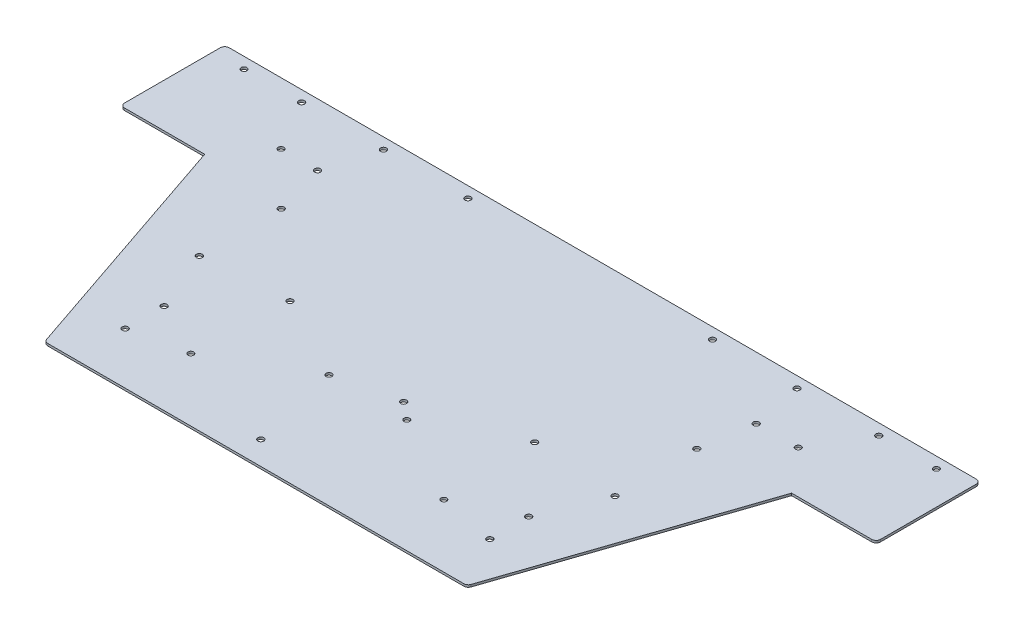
ISO-10303-21;
HEADER;
FILE_DESCRIPTION(('STEP AP214'),'2;1');
FILE_NAME('part.step','',(''),(''),'','','');
FILE_SCHEMA(('AUTOMOTIVE_DESIGN { 1 0 10303 214 1 1 1 1 }'));
ENDSEC;
DATA;
#1=APPLICATION_CONTEXT('core data for automotive mechanical design processes');
#2=APPLICATION_PROTOCOL_DEFINITION('international standard','automotive_design',2000,#1);
#3=PRODUCT_CONTEXT('',#1,'mechanical');
#4=PRODUCT('Part','Part','',(#3));
#5=PRODUCT_RELATED_PRODUCT_CATEGORY('part','',(#4));
#6=PRODUCT_DEFINITION_FORMATION('','',#4);
#7=PRODUCT_DEFINITION_CONTEXT('part definition',#1,'design');
#8=PRODUCT_DEFINITION('design','',#6,#7);
#9=PRODUCT_DEFINITION_SHAPE('','',#8);
#10=(LENGTH_UNIT() NAMED_UNIT(*) SI_UNIT(.MILLI.,.METRE.));
#11=(NAMED_UNIT(*) PLANE_ANGLE_UNIT() SI_UNIT($,.RADIAN.));
#12=(NAMED_UNIT(*) SI_UNIT($,.STERADIAN.) SOLID_ANGLE_UNIT());
#13=UNCERTAINTY_MEASURE_WITH_UNIT(LENGTH_MEASURE(1.E-05),#10,'distance_accuracy_value','');
#14=(GEOMETRIC_REPRESENTATION_CONTEXT(3) GLOBAL_UNCERTAINTY_ASSIGNED_CONTEXT((#13)) GLOBAL_UNIT_ASSIGNED_CONTEXT((#10,
#11,#12)) REPRESENTATION_CONTEXT('',''));
#15=CARTESIAN_POINT('',(0.,0.,0.));
#16=DIRECTION('',(0.,0.,1.));
#17=DIRECTION('',(1.,0.,0.));
#18=AXIS2_PLACEMENT_3D('',#15,#16,#17);
#19=CARTESIAN_POINT('',(669.459851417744,1.52399999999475,-66.0750350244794));
#20=DIRECTION('',(0.,1.,0.));
#21=DIRECTION('',(0.,0.,1.00000000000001));
#22=AXIS2_PLACEMENT_3D('',#19,#20,#21);
#23=CYLINDRICAL_SURFACE('',#22,5.08);
#24=DIRECTION('',(0.,1.,0.));
#25=VECTOR('',#24,1.);
#26=CARTESIAN_POINT('',(669.459851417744,1.52400000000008,-60.9950350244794));
#27=LINE('',#26,#25);
#28=CARTESIAN_POINT('',(669.459851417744,-1.01599999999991,-60.9950350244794));
#29=VERTEX_POINT('',#28);
#30=CARTESIAN_POINT('',(669.459851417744,1.52400000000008,-60.9950350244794));
#31=VERTEX_POINT('',#30);
#32=EDGE_CURVE('E339',#29,#31,#27,.T.);
#33=ORIENTED_EDGE('',*,*,#32,.F.);
#34=CARTESIAN_POINT('',(669.459851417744,-1.01600000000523,-66.0750350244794));
#35=DIRECTION('',(0.,1.,0.));
#36=DIRECTION('',(0.,0.,1.00000000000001));
#37=AXIS2_PLACEMENT_3D('',#34,#35,#36);
#38=CIRCLE('',#37,5.08);
#39=CARTESIAN_POINT('',(674.27020042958,-1.01599999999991,-64.4419574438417));
#40=VERTEX_POINT('',#39);
#41=EDGE_CURVE('E51',#40,#29,#38,.F.);
#42=ORIENTED_EDGE('',*,*,#41,.F.);
#43=DIRECTION('',(0.,1.,0.));
#44=VECTOR('',#43,1.);
#45=CARTESIAN_POINT('',(674.270200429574,1.52400000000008,-64.4419574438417));
#46=LINE('',#45,#44);
#47=CARTESIAN_POINT('',(674.270200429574,1.52400000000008,-64.4419574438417));
#48=VERTEX_POINT('',#47);
#49=EDGE_CURVE('E343',#48,#40,#46,.F.);
#50=ORIENTED_EDGE('',*,*,#49,.F.);
#51=CARTESIAN_POINT('',(669.459851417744,1.52399999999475,-66.0750350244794));
#52=DIRECTION('',(0.,1.,0.));
#53=DIRECTION('',(0.,0.,1.00000000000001));
#54=AXIS2_PLACEMENT_3D('',#51,#52,#53);
#55=CIRCLE('',#54,5.08);
#56=EDGE_CURVE('E11',#31,#48,#55,.T.);
#57=ORIENTED_EDGE('',*,*,#56,.F.);
#58=EDGE_LOOP('',(#33,#42,#50,#57));
#59=FACE_BOUND('',#58,.T.);
#60=ADVANCED_FACE('F43',(#59),#23,.T.);
#61=CARTESIAN_POINT('',(194.140140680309,1.52399999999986,-66.0750350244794));
#62=DIRECTION('',(0.,1.,0.));
#63=DIRECTION('',(0.,0.,1.00000000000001));
#64=AXIS2_PLACEMENT_3D('',#61,#62,#63);
#65=CYLINDRICAL_SURFACE('',#64,5.08);
#66=DIRECTION('',(0.,1.,0.));
#67=VECTOR('',#66,1.);
#68=CARTESIAN_POINT('',(189.329791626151,1.52400000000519,-64.4419575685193));
#69=LINE('',#68,#67);
#70=CARTESIAN_POINT('',(189.329791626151,-1.0159999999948,-64.4419575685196));
#71=VERTEX_POINT('',#70);
#72=CARTESIAN_POINT('',(189.329791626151,1.52400000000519,-64.4419575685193));
#73=VERTEX_POINT('',#72);
#74=EDGE_CURVE('E325',#71,#73,#69,.T.);
#75=ORIENTED_EDGE('',*,*,#74,.F.);
#76=CARTESIAN_POINT('',(194.140140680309,-1.01600000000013,-66.0750350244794));
#77=DIRECTION('',(0.,1.,0.));
#78=DIRECTION('',(0.,0.,1.00000000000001));
#79=AXIS2_PLACEMENT_3D('',#76,#77,#78);
#80=CIRCLE('',#79,5.08);
#81=CARTESIAN_POINT('',(194.140140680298,-1.01599999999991,-60.9950350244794));
#82=VERTEX_POINT('',#81);
#83=EDGE_CURVE('E333',#82,#71,#80,.F.);
#84=ORIENTED_EDGE('',*,*,#83,.F.);
#85=DIRECTION('',(0.,1.,0.));
#86=VECTOR('',#85,1.);
#87=CARTESIAN_POINT('',(194.140140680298,1.52400000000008,-60.9950350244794));
#88=LINE('',#87,#86);
#89=CARTESIAN_POINT('',(194.140140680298,1.52400000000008,-60.9950350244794));
#90=VERTEX_POINT('',#89);
#91=EDGE_CURVE('E329',#90,#82,#88,.F.);
#92=ORIENTED_EDGE('',*,*,#91,.F.);
#93=CARTESIAN_POINT('',(194.140140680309,1.52399999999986,-66.0750350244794));
#94=DIRECTION('',(0.,1.,0.));
#95=DIRECTION('',(0.,0.,1.00000000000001));
#96=AXIS2_PLACEMENT_3D('',#93,#94,#95);
#97=CIRCLE('',#96,5.08);
#98=EDGE_CURVE('E336',#73,#90,#97,.T.);
#99=ORIENTED_EDGE('',*,*,#98,.F.);
#100=EDGE_LOOP('',(#75,#84,#92,#99));
#101=FACE_BOUND('',#100,.T.);
#102=ADVANCED_FACE('F356',(#101),#65,.T.);
#103=CARTESIAN_POINT('',(5.08000000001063,1.52400000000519,-452.119984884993));
#104=DIRECTION('',(0.,-1.,0.));
#105=DIRECTION('',(0.,0.,-1.00000000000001));
#106=AXIS2_PLACEMENT_3D('',#103,#104,#105);
#107=CYLINDRICAL_SURFACE('',#106,5.08);
#108=DIRECTION('',(0.,-1.,0.));
#109=VECTOR('',#108,1.);
#110=CARTESIAN_POINT('',(0.,1.52400000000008,-452.119984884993));
#111=LINE('',#110,#109);
#112=CARTESIAN_POINT('',(0.,1.52400000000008,-452.119984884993));
#113=VERTEX_POINT('',#112);
#114=CARTESIAN_POINT('',(0.,-1.01600000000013,-452.119984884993));
#115=VERTEX_POINT('',#114);
#116=EDGE_CURVE('E311',#113,#115,#111,.T.);
#117=ORIENTED_EDGE('',*,*,#116,.F.);
#118=CARTESIAN_POINT('',(5.08000000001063,1.52400000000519,-452.119984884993));
#119=DIRECTION('',(0.,1.,0.));
#120=DIRECTION('',(0.,0.,1.00000000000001));
#121=AXIS2_PLACEMENT_3D('',#118,#119,#120);
#122=CIRCLE('',#121,5.08);
#123=CARTESIAN_POINT('',(5.07999999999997,1.52400000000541,-457.199984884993));
#124=VERTEX_POINT('',#123);
#125=EDGE_CURVE('E319',#124,#113,#122,.T.);
#126=ORIENTED_EDGE('',*,*,#125,.F.);
#127=DIRECTION('',(0.,-1.,0.));
#128=VECTOR('',#127,1.);
#129=CARTESIAN_POINT('',(5.07999999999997,1.52400000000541,-457.199984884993));
#130=LINE('',#129,#128);
#131=CARTESIAN_POINT('',(5.07999999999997,-1.0159999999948,-457.199984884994));
#132=VERTEX_POINT('',#131);
#133=EDGE_CURVE('E315',#132,#124,#130,.F.);
#134=ORIENTED_EDGE('',*,*,#133,.F.);
#135=CARTESIAN_POINT('',(5.08000000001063,-1.0159999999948,-452.119984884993));
#136=DIRECTION('',(0.,1.,0.));
#137=DIRECTION('',(0.,0.,1.00000000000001));
#138=AXIS2_PLACEMENT_3D('',#135,#136,#137);
#139=CIRCLE('',#138,5.08);
#140=EDGE_CURVE('E322',#115,#132,#139,.F.);
#141=ORIENTED_EDGE('',*,*,#140,.F.);
#142=EDGE_LOOP('',(#117,#126,#134,#141));
#143=FACE_BOUND('',#142,.T.);
#144=ADVANCED_FACE('F379',(#143),#107,.T.);
#145=CARTESIAN_POINT('',(858.520000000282,1.52400000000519,-452.119984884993));
#146=DIRECTION('',(0.,1.,0.));
#147=DIRECTION('',(0.,0.,1.00000000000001));
#148=AXIS2_PLACEMENT_3D('',#145,#146,#147);
#149=CYLINDRICAL_SURFACE('',#148,5.08);
#150=DIRECTION('',(0.,1.,0.));
#151=VECTOR('',#150,1.);
#152=CARTESIAN_POINT('',(863.600000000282,1.52400000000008,-452.119984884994));
#153=LINE('',#152,#151);
#154=CARTESIAN_POINT('',(863.600000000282,-1.01599999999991,-452.119984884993));
#155=VERTEX_POINT('',#154);
#156=CARTESIAN_POINT('',(863.600000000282,1.52400000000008,-452.119984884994));
#157=VERTEX_POINT('',#156);
#158=EDGE_CURVE('E297',#155,#157,#153,.T.);
#159=ORIENTED_EDGE('',*,*,#158,.F.);
#160=CARTESIAN_POINT('',(858.520000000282,-1.0159999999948,-452.119984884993));
#161=DIRECTION('',(0.,1.,0.));
#162=DIRECTION('',(0.,0.,1.00000000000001));
#163=AXIS2_PLACEMENT_3D('',#160,#161,#162);
#164=CIRCLE('',#163,5.08);
#165=CARTESIAN_POINT('',(858.520000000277,-1.0159999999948,-457.199984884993));
#166=VERTEX_POINT('',#165);
#167=EDGE_CURVE('E305',#166,#155,#164,.F.);
#168=ORIENTED_EDGE('',*,*,#167,.F.);
#169=DIRECTION('',(0.,1.,0.));
#170=VECTOR('',#169,1.);
#171=CARTESIAN_POINT('',(858.520000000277,1.52400000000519,-457.199984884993));
#172=LINE('',#171,#170);
#173=CARTESIAN_POINT('',(858.520000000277,1.52400000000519,-457.199984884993));
#174=VERTEX_POINT('',#173);
#175=EDGE_CURVE('E301',#174,#166,#172,.F.);
#176=ORIENTED_EDGE('',*,*,#175,.F.);
#177=CARTESIAN_POINT('',(858.520000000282,1.52400000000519,-452.119984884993));
#178=DIRECTION('',(0.,1.,0.));
#179=DIRECTION('',(0.,0.,1.00000000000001));
#180=AXIS2_PLACEMENT_3D('',#177,#178,#179);
#181=CIRCLE('',#180,5.08);
#182=EDGE_CURVE('E308',#157,#174,#181,.T.);
#183=ORIENTED_EDGE('',*,*,#182,.F.);
#184=EDGE_LOOP('',(#159,#168,#176,#183));
#185=FACE_BOUND('',#184,.T.);
#186=ADVANCED_FACE('F387',(#185),#149,.T.);
#187=CARTESIAN_POINT('',(858.520000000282,1.52400000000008,-342.899984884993));
#188=DIRECTION('',(0.,1.,0.));
#189=DIRECTION('',(0.,0.,1.00000000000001));
#190=AXIS2_PLACEMENT_3D('',#187,#188,#189);
#191=CYLINDRICAL_SURFACE('',#190,5.08);
#192=DIRECTION('',(0.,1.,0.));
#193=VECTOR('',#192,1.);
#194=CARTESIAN_POINT('',(858.520000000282,1.52400000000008,-337.819984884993));
#195=LINE('',#194,#193);
#196=CARTESIAN_POINT('',(858.520000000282,-1.01600000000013,-337.819984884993));
#197=VERTEX_POINT('',#196);
#198=CARTESIAN_POINT('',(858.520000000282,1.52400000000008,-337.819984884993));
#199=VERTEX_POINT('',#198);
#200=EDGE_CURVE('E164',#197,#199,#195,.T.);
#201=ORIENTED_EDGE('',*,*,#200,.F.);
#202=CARTESIAN_POINT('',(858.520000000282,-1.01599999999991,-342.899984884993));
#203=DIRECTION('',(0.,1.,0.));
#204=DIRECTION('',(0.,0.,1.00000000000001));
#205=AXIS2_PLACEMENT_3D('',#202,#203,#204);
#206=CIRCLE('',#205,5.08);
#207=CARTESIAN_POINT('',(863.600000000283,-1.01600000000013,-342.899984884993));
#208=VERTEX_POINT('',#207);
#209=EDGE_CURVE('E291',#208,#197,#206,.F.);
#210=ORIENTED_EDGE('',*,*,#209,.F.);
#211=DIRECTION('',(0.,1.,0.));
#212=VECTOR('',#211,1.);
#213=CARTESIAN_POINT('',(863.600000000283,1.52400000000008,-342.899984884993));
#214=LINE('',#213,#212);
#215=CARTESIAN_POINT('',(863.600000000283,1.52400000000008,-342.899984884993));
#216=VERTEX_POINT('',#215);
#217=EDGE_CURVE('E287',#216,#208,#214,.F.);
#218=ORIENTED_EDGE('',*,*,#217,.F.);
#219=CARTESIAN_POINT('',(858.520000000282,1.52400000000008,-342.899984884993));
#220=DIRECTION('',(0.,1.,0.));
#221=DIRECTION('',(0.,0.,1.00000000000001));
#222=AXIS2_PLACEMENT_3D('',#219,#220,#221);
#223=CIRCLE('',#222,5.08);
#224=EDGE_CURVE('E294',#199,#216,#223,.T.);
#225=ORIENTED_EDGE('',*,*,#224,.F.);
#226=EDGE_LOOP('',(#201,#210,#218,#225));
#227=FACE_BOUND('',#226,.T.);
#228=ADVANCED_FACE('F393',(#227),#191,.T.);
#229=CARTESIAN_POINT('',(5.08000000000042,1.52400000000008,-342.899984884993));
#230=DIRECTION('',(0.,1.,0.));
#231=DIRECTION('',(0.,0.,1.00000000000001));
#232=AXIS2_PLACEMENT_3D('',#229,#230,#231);
#233=CYLINDRICAL_SURFACE('',#232,5.08);
#234=DIRECTION('',(0.,1.,0.));
#235=VECTOR('',#234,1.);
#236=CARTESIAN_POINT('',(1.06581410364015E-11,1.52399999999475,-342.899984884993));
#237=LINE('',#236,#235);
#238=CARTESIAN_POINT('',(1.06581410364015E-11,-1.01600000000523,-342.899984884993));
#239=VERTEX_POINT('',#238);
#240=CARTESIAN_POINT('',(1.06581410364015E-11,1.52399999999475,-342.899984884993));
#241=VERTEX_POINT('',#240);
#242=EDGE_CURVE('E269',#239,#241,#237,.T.);
#243=ORIENTED_EDGE('',*,*,#242,.F.);
#244=CARTESIAN_POINT('',(5.07999999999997,-1.01599999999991,-342.899984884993));
#245=DIRECTION('',(0.,1.,0.));
#246=DIRECTION('',(0.,0.,1.00000000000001));
#247=AXIS2_PLACEMENT_3D('',#244,#245,#246);
#248=CIRCLE('',#247,5.08);
#249=CARTESIAN_POINT('',(5.08000000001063,-1.01599999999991,-337.819984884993));
#250=VERTEX_POINT('',#249);
#251=EDGE_CURVE('E278',#250,#239,#248,.F.);
#252=ORIENTED_EDGE('',*,*,#251,.F.);
#253=DIRECTION('',(0.,1.,0.));
#254=VECTOR('',#253,1.);
#255=CARTESIAN_POINT('',(5.08000000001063,1.52400000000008,-337.819984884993));
#256=LINE('',#255,#254);
#257=CARTESIAN_POINT('',(5.08000000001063,1.52400000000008,-337.819984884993));
#258=VERTEX_POINT('',#257);
#259=EDGE_CURVE('E274',#258,#250,#256,.F.);
#260=ORIENTED_EDGE('',*,*,#259,.F.);
#261=CARTESIAN_POINT('',(5.08000000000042,1.52400000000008,-342.899984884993));
#262=DIRECTION('',(0.,1.,0.));
#263=DIRECTION('',(0.,0.,1.00000000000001));
#264=AXIS2_PLACEMENT_3D('',#261,#262,#263);
#265=CIRCLE('',#264,5.08);
#266=EDGE_CURVE('E282',#241,#258,#265,.T.);
#267=ORIENTED_EDGE('',*,*,#266,.F.);
#268=EDGE_LOOP('',(#243,#252,#260,#267));
#269=FACE_BOUND('',#268,.T.);
#270=ADVANCED_FACE('F370',(#269),#233,.T.);
#271=CARTESIAN_POINT('',(863.600000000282,1.52400000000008,-355.599984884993));
#272=DIRECTION('',(1.00000000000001,0.,0.));
#273=DIRECTION('',(0.,0.,-1.00000000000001));
#274=AXIS2_PLACEMENT_3D('',#271,#272,#273);
#275=PLANE('',#274);
#276=DIRECTION('',(0.,0.,1.00000000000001));
#277=VECTOR('',#276,1.);
#278=CARTESIAN_POINT('',(863.600000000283,-1.0159999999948,-5.32907051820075E-12));
#279=LINE('',#278,#277);
#280=EDGE_CURVE('E261',#208,#155,#279,.F.);
#281=ORIENTED_EDGE('',*,*,#280,.T.);
#282=ORIENTED_EDGE('',*,*,#158,.T.);
#283=DIRECTION('',(0.,0.,-1.00000000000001));
#284=VECTOR('',#283,1.);
#285=CARTESIAN_POINT('',(863.600000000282,1.52400000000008,-355.599984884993));
#286=LINE('',#285,#284);
#287=EDGE_CURVE('E166',#216,#157,#286,.T.);
#288=ORIENTED_EDGE('',*,*,#287,.F.);
#289=ORIENTED_EDGE('',*,*,#217,.T.);
#290=EDGE_LOOP('',(#281,#282,#288,#289));
#291=FACE_BOUND('',#290,.T.);
#292=ADVANCED_FACE('F390',(#291),#275,.T.);
#293=CARTESIAN_POINT('',(431.800000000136,1.52400000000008,-457.199984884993));
#294=DIRECTION('',(0.,0.,-1.00000000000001));
#295=DIRECTION('',(-1.00000000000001,0.,0.));
#296=AXIS2_PLACEMENT_3D('',#293,#294,#295);
#297=PLANE('',#296);
#298=DIRECTION('',(1.00000000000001,0.,0.));
#299=VECTOR('',#298,1.);
#300=CARTESIAN_POINT('',(1.06581410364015E-11,-1.01599999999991,-457.199984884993));
#301=LINE('',#300,#299);
#302=EDGE_CURVE('E257',#166,#132,#301,.F.);
#303=ORIENTED_EDGE('',*,*,#302,.T.);
#304=ORIENTED_EDGE('',*,*,#133,.T.);
#305=DIRECTION('',(-1.00000000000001,0.,0.));
#306=VECTOR('',#305,1.);
#307=CARTESIAN_POINT('',(431.800000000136,1.52400000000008,-457.199984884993));
#308=LINE('',#307,#306);
#309=EDGE_CURVE('E171',#174,#124,#308,.T.);
#310=ORIENTED_EDGE('',*,*,#309,.F.);
#311=ORIENTED_EDGE('',*,*,#175,.T.);
#312=EDGE_LOOP('',(#303,#304,#310,#311));
#313=FACE_BOUND('',#312,.T.);
#314=ADVANCED_FACE('F382',(#313),#297,.T.);
#315=CARTESIAN_POINT('',(1.06581410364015E-11,1.52400000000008,-457.199984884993));
#316=DIRECTION('',(-1.00000000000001,0.,0.));
#317=DIRECTION('',(0.,0.,1.00000000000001));
#318=AXIS2_PLACEMENT_3D('',#315,#316,#317);
#319=PLANE('',#318);
#320=DIRECTION('',(0.,0.,1.00000000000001));
#321=VECTOR('',#320,1.);
#322=CARTESIAN_POINT('',(1.06581410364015E-11,1.52400000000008,-457.199984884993));
#323=LINE('',#322,#321);
#324=EDGE_CURVE('E178',#113,#241,#323,.T.);
#325=ORIENTED_EDGE('',*,*,#324,.F.);
#326=ORIENTED_EDGE('',*,*,#116,.T.);
#327=DIRECTION('',(0.,0.,1.00000000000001));
#328=VECTOR('',#327,1.);
#329=CARTESIAN_POINT('',(0.,-1.01599999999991,0.));
#330=LINE('',#329,#328);
#331=EDGE_CURVE('E254',#115,#239,#330,.T.);
#332=ORIENTED_EDGE('',*,*,#331,.T.);
#333=ORIENTED_EDGE('',*,*,#242,.T.);
#334=EDGE_LOOP('',(#325,#326,#332,#333));
#335=FACE_BOUND('',#334,.T.);
#336=ADVANCED_FACE('F376',(#335),#319,.T.);
#337=CARTESIAN_POINT('',(1.06581410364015E-11,1.52399999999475,-337.819984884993));
#338=DIRECTION('',(0.,0.,1.00000000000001));
#339=DIRECTION('',(1.00000000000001,0.,0.));
#340=AXIS2_PLACEMENT_3D('',#337,#338,#339);
#341=PLANE('',#340);
#342=DIRECTION('',(1.00000000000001,0.,0.));
#343=VECTOR('',#342,1.);
#344=CARTESIAN_POINT('',(1.06581410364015E-11,1.52399999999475,-337.819984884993));
#345=LINE('',#344,#343);
#346=CARTESIAN_POINT('',(96.5199999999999,1.52399999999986,-337.819984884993));
#347=VERTEX_POINT('',#346);
#348=EDGE_CURVE('E181',#258,#347,#345,.T.);
#349=ORIENTED_EDGE('',*,*,#348,.F.);
#350=ORIENTED_EDGE('',*,*,#259,.T.);
#351=DIRECTION('',(1.00000000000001,0.,0.));
#352=VECTOR('',#351,1.);
#353=CARTESIAN_POINT('',(1.06581410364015E-11,-1.01600000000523,-337.819984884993));
#354=LINE('',#353,#352);
#355=CARTESIAN_POINT('',(96.5199999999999,-1.01600000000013,-337.819984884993));
#356=VERTEX_POINT('',#355);
#357=EDGE_CURVE('E251',#250,#356,#354,.T.);
#358=ORIENTED_EDGE('',*,*,#357,.T.);
#359=DIRECTION('',(0.,1.,0.));
#360=VECTOR('',#359,1.);
#361=CARTESIAN_POINT('',(96.5199999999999,1.52399999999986,-337.819984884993));
#362=LINE('',#361,#360);
#363=EDGE_CURVE('E158',#356,#347,#362,.T.);
#364=ORIENTED_EDGE('',*,*,#363,.T.);
#365=EDGE_LOOP('',(#349,#350,#358,#364));
#366=FACE_BOUND('',#365,.T.);
#367=ADVANCED_FACE('F365',(#366),#341,.T.);
#368=CARTESIAN_POINT('',(96.5199999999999,1.52399999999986,-337.819984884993));
#369=DIRECTION('',(-0.946919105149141,0.,0.321471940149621));
#370=DIRECTION('',(0.321471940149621,0.,0.946919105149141));
#371=AXIS2_PLACEMENT_3D('',#368,#369,#370);
#372=PLANE('',#371);
#373=DIRECTION('',(0.321471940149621,0.,0.946919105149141));
#374=VECTOR('',#373,1.);
#375=CARTESIAN_POINT('',(96.5199999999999,-1.01600000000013,-337.819984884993));
#376=LINE('',#375,#374);
#377=EDGE_CURVE('E247',#356,#71,#376,.T.);
#378=ORIENTED_EDGE('',*,*,#377,.T.);
#379=ORIENTED_EDGE('',*,*,#74,.T.);
#380=DIRECTION('',(0.321471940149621,0.,0.946919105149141));
#381=VECTOR('',#380,1.);
#382=CARTESIAN_POINT('',(96.5199999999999,1.52399999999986,-337.819984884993));
#383=LINE('',#382,#381);
#384=EDGE_CURVE('E184',#347,#73,#383,.T.);
#385=ORIENTED_EDGE('',*,*,#384,.F.);
#386=ORIENTED_EDGE('',*,*,#363,.F.);
#387=EDGE_LOOP('',(#378,#379,#385,#386));
#388=FACE_BOUND('',#387,.T.);
#389=ADVANCED_FACE('F361',(#388),#372,.T.);
#390=CARTESIAN_POINT('',(431.799995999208,1.52400000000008,-60.9950350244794));
#391=DIRECTION('',(0.,0.,1.00000000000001));
#392=DIRECTION('',(1.00000000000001,0.,0.));
#393=AXIS2_PLACEMENT_3D('',#390,#391,#392);
#394=PLANE('',#393);
#395=DIRECTION('',(1.00000000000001,0.,0.));
#396=VECTOR('',#395,1.);
#397=CARTESIAN_POINT('',(1.06581410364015E-11,-1.01599999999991,-60.9950350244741));
#398=LINE('',#397,#396);
#399=EDGE_CURVE('E242',#82,#29,#398,.T.);
#400=ORIENTED_EDGE('',*,*,#399,.T.);
#401=ORIENTED_EDGE('',*,*,#32,.T.);
#402=DIRECTION('',(1.00000000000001,0.,0.));
#403=VECTOR('',#402,1.);
#404=CARTESIAN_POINT('',(431.799995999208,1.52400000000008,-60.9950350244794));
#405=LINE('',#404,#403);
#406=EDGE_CURVE('E159',#90,#31,#405,.T.);
#407=ORIENTED_EDGE('',*,*,#406,.F.);
#408=ORIENTED_EDGE('',*,*,#91,.T.);
#409=EDGE_LOOP('',(#400,#401,#407,#408));
#410=FACE_BOUND('',#409,.T.);
#411=ADVANCED_FACE('F352',(#410),#394,.T.);
#412=CARTESIAN_POINT('',(673.099995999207,1.52400000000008,-60.9950350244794));
#413=DIRECTION('',(0.946919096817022,0.,0.321471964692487));
#414=DIRECTION('',(0.321471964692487,0.,-0.946919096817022));
#415=AXIS2_PLACEMENT_3D('',#412,#413,#414);
#416=PLANE('',#415);
#417=DIRECTION('',(0.321471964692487,0.,-0.946919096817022));
#418=VECTOR('',#417,1.);
#419=CARTESIAN_POINT('',(673.099995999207,1.52400000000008,-60.9950350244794));
#420=LINE('',#419,#418);
#421=CARTESIAN_POINT('',(767.080000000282,1.52400000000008,-337.819984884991));
#422=VERTEX_POINT('',#421);
#423=EDGE_CURVE('E140',#48,#422,#420,.T.);
#424=ORIENTED_EDGE('',*,*,#423,.F.);
#425=ORIENTED_EDGE('',*,*,#49,.T.);
#426=DIRECTION('',(0.321471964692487,0.,-0.946919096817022));
#427=VECTOR('',#426,1.);
#428=CARTESIAN_POINT('',(673.099995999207,-1.01599999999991,-60.9950350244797));
#429=LINE('',#428,#427);
#430=CARTESIAN_POINT('',(767.080000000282,-1.01599999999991,-337.819984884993));
#431=VERTEX_POINT('',#430);
#432=EDGE_CURVE('E153',#40,#431,#429,.T.);
#433=ORIENTED_EDGE('',*,*,#432,.T.);
#434=DIRECTION('',(0.,1.,0.));
#435=VECTOR('',#434,1.);
#436=CARTESIAN_POINT('',(767.080000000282,1.52400000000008,-337.819984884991));
#437=LINE('',#436,#435);
#438=EDGE_CURVE('E150',#431,#422,#437,.T.);
#439=ORIENTED_EDGE('',*,*,#438,.T.);
#440=EDGE_LOOP('',(#424,#425,#433,#439));
#441=FACE_BOUND('',#440,.T.);
#442=ADVANCED_FACE('F151',(#441),#416,.T.);
#443=CARTESIAN_POINT('',(290.56396536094,1.52400000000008,-241.297380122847));
#444=DIRECTION('',(0.,1.,0.));
#445=DIRECTION('',(0.,0.,1.00000000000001));
#446=AXIS2_PLACEMENT_3D('',#443,#444,#445);
#447=CYLINDRICAL_SURFACE('',#446,3.3782);
#448=CARTESIAN_POINT('',(290.56396536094,1.52400000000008,-241.297380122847));
#449=DIRECTION('',(0.,1.,0.));
#450=DIRECTION('',(0.,0.,1.00000000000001));
#451=AXIS2_PLACEMENT_3D('',#448,#449,#450);
#452=CIRCLE('',#451,3.3782);
#453=CARTESIAN_POINT('',(290.56396536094,1.52400000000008,-237.919180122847));
#454=VERTEX_POINT('',#453);
#455=EDGE_CURVE('E246',#454,#454,#452,.T.);
#456=ORIENTED_EDGE('',*,*,#455,.T.);
#457=EDGE_LOOP('',(#456));
#458=FACE_BOUND('',#457,.T.);
#459=CARTESIAN_POINT('',(290.56396536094,-1.01599999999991,-241.297380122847));
#460=DIRECTION('',(0.,1.,0.));
#461=DIRECTION('',(0.,0.,1.00000000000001));
#462=AXIS2_PLACEMENT_3D('',#459,#460,#461);
#463=CIRCLE('',#462,3.3782);
#464=CARTESIAN_POINT('',(290.56396536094,-1.01599999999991,-237.919180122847));
#465=VERTEX_POINT('',#464);
#466=EDGE_CURVE('E190',#465,#465,#463,.T.);
#467=ORIENTED_EDGE('',*,*,#466,.F.);
#468=EDGE_LOOP('',(#467));
#469=FACE_BOUND('',#468,.T.);
#470=ADVANCED_FACE('F491',(#458,#469),#447,.F.);
#471=CARTESIAN_POINT('',(290.560217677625,1.52399999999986,-444.497380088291));
#472=DIRECTION('',(0.,1.,0.));
#473=DIRECTION('',(0.,0.,1.00000000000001));
#474=AXIS2_PLACEMENT_3D('',#471,#472,#473);
#475=CYLINDRICAL_SURFACE('',#474,3.3782);
#476=CARTESIAN_POINT('',(290.560217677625,1.52399999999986,-444.497380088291));
#477=DIRECTION('',(0.,1.,0.));
#478=DIRECTION('',(0.,0.,1.00000000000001));
#479=AXIS2_PLACEMENT_3D('',#476,#477,#478);
#480=CIRCLE('',#479,3.3782);
#481=CARTESIAN_POINT('',(290.560217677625,1.52399999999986,-441.119180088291));
#482=VERTEX_POINT('',#481);
#483=EDGE_CURVE('E957',#482,#482,#480,.T.);
#484=ORIENTED_EDGE('',*,*,#483,.T.);
#485=EDGE_LOOP('',(#484));
#486=FACE_BOUND('',#485,.T.);
#487=CARTESIAN_POINT('',(290.560217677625,-1.01600000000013,-444.497380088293));
#488=DIRECTION('',(0.,1.,0.));
#489=DIRECTION('',(0.,0.,1.00000000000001));
#490=AXIS2_PLACEMENT_3D('',#487,#488,#489);
#491=CIRCLE('',#490,3.3782);
#492=CARTESIAN_POINT('',(290.560217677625,-1.01600000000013,-441.119180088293));
#493=VERTEX_POINT('',#492);
#494=EDGE_CURVE('E194',#493,#493,#491,.T.);
#495=ORIENTED_EDGE('',*,*,#494,.F.);
#496=EDGE_LOOP('',(#495));
#497=FACE_BOUND('',#496,.T.);
#498=ADVANCED_FACE('F501',(#486,#497),#475,.F.);
#499=CARTESIAN_POINT('',(569.960217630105,1.52400000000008,-444.502533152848));
#500=DIRECTION('',(0.,1.,0.));
#501=DIRECTION('',(0.,0.,1.00000000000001));
#502=AXIS2_PLACEMENT_3D('',#499,#500,#501);
#503=CYLINDRICAL_SURFACE('',#502,3.3782);
#504=CARTESIAN_POINT('',(569.960217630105,1.52400000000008,-444.502533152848));
#505=DIRECTION('',(0.,1.,0.));
#506=DIRECTION('',(0.,0.,1.00000000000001));
#507=AXIS2_PLACEMENT_3D('',#504,#505,#506);
#508=CIRCLE('',#507,3.3782);
#509=CARTESIAN_POINT('',(569.960217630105,1.52400000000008,-441.124333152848));
#510=VERTEX_POINT('',#509);
#511=EDGE_CURVE('E961',#510,#510,#508,.T.);
#512=ORIENTED_EDGE('',*,*,#511,.T.);
#513=EDGE_LOOP('',(#512));
#514=FACE_BOUND('',#513,.T.);
#515=CARTESIAN_POINT('',(569.960217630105,-1.01599999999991,-444.502533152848));
#516=DIRECTION('',(0.,1.,0.));
#517=DIRECTION('',(0.,0.,1.00000000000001));
#518=AXIS2_PLACEMENT_3D('',#515,#516,#517);
#519=CIRCLE('',#518,3.3782);
#520=CARTESIAN_POINT('',(569.960217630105,-1.01599999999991,-441.124333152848));
#521=VERTEX_POINT('',#520);
#522=EDGE_CURVE('E199',#521,#521,#519,.T.);
#523=ORIENTED_EDGE('',*,*,#522,.F.);
#524=EDGE_LOOP('',(#523));
#525=FACE_BOUND('',#524,.T.);
#526=ADVANCED_FACE('F512',(#514,#525),#503,.F.);
#527=CARTESIAN_POINT('',(569.96396531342,1.52400000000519,-241.302533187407));
#528=DIRECTION('',(0.,1.,0.));
#529=DIRECTION('',(0.,0.,1.00000000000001));
#530=AXIS2_PLACEMENT_3D('',#527,#528,#529);
#531=CYLINDRICAL_SURFACE('',#530,3.3782);
#532=CARTESIAN_POINT('',(569.96396531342,1.52400000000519,-241.302533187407));
#533=DIRECTION('',(0.,1.,0.));
#534=DIRECTION('',(0.,0.,1.00000000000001));
#535=AXIS2_PLACEMENT_3D('',#532,#533,#534);
#536=CIRCLE('',#535,3.3782);
#537=CARTESIAN_POINT('',(569.96396531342,1.52400000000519,-237.924333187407));
#538=VERTEX_POINT('',#537);
#539=EDGE_CURVE('E965',#538,#538,#536,.T.);
#540=ORIENTED_EDGE('',*,*,#539,.T.);
#541=EDGE_LOOP('',(#540));
#542=FACE_BOUND('',#541,.T.);
#543=CARTESIAN_POINT('',(569.96396531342,-1.0159999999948,-241.302533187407));
#544=DIRECTION('',(0.,1.,0.));
#545=DIRECTION('',(0.,0.,1.00000000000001));
#546=AXIS2_PLACEMENT_3D('',#543,#544,#545);
#547=CIRCLE('',#546,3.3782);
#548=CARTESIAN_POINT('',(569.96396531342,-1.0159999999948,-237.924333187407));
#549=VERTEX_POINT('',#548);
#550=EDGE_CURVE('E203',#549,#549,#547,.T.);
#551=ORIENTED_EDGE('',*,*,#550,.F.);
#552=EDGE_LOOP('',(#551));
#553=FACE_BOUND('',#552,.T.);
#554=ADVANCED_FACE('F523',(#542,#553),#531,.F.);
#555=CARTESIAN_POINT('',(100.540217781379,1.52400000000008,-444.493875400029));
#556=DIRECTION('',(0.,1.,0.));
#557=DIRECTION('',(0.,0.,1.00000000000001));
#558=AXIS2_PLACEMENT_3D('',#555,#556,#557);
#559=CYLINDRICAL_SURFACE('',#558,3.37819999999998);
#560=CARTESIAN_POINT('',(100.540217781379,1.52400000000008,-444.493875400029));
#561=DIRECTION('',(0.,1.,0.));
#562=DIRECTION('',(0.,0.,1.00000000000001));
#563=AXIS2_PLACEMENT_3D('',#560,#561,#562);
#564=CIRCLE('',#563,3.37819999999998);
#565=CARTESIAN_POINT('',(100.540217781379,1.52400000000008,-441.115675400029));
#566=VERTEX_POINT('',#565);
#567=EDGE_CURVE('E969',#566,#566,#564,.T.);
#568=ORIENTED_EDGE('',*,*,#567,.T.);
#569=EDGE_LOOP('',(#568));
#570=FACE_BOUND('',#569,.T.);
#571=CARTESIAN_POINT('',(100.540217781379,-1.01599999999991,-444.493875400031));
#572=DIRECTION('',(0.,1.,0.));
#573=DIRECTION('',(0.,0.,1.00000000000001));
#574=AXIS2_PLACEMENT_3D('',#571,#572,#573);
#575=CIRCLE('',#574,3.37819999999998);
#576=CARTESIAN_POINT('',(100.540217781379,-1.01599999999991,-441.115675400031));
#577=VERTEX_POINT('',#576);
#578=EDGE_CURVE('E207',#577,#577,#575,.T.);
#579=ORIENTED_EDGE('',*,*,#578,.F.);
#580=EDGE_LOOP('',(#579));
#581=FACE_BOUND('',#580,.T.);
#582=ADVANCED_FACE('F534',(#570,#581),#559,.F.);
#583=CARTESIAN_POINT('',(194.040217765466,1.52400000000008,-444.495599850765));
#584=DIRECTION('',(0.,1.,0.));
#585=DIRECTION('',(0.,0.,1.00000000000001));
#586=AXIS2_PLACEMENT_3D('',#583,#584,#585);
#587=CYLINDRICAL_SURFACE('',#586,3.3782);
#588=CARTESIAN_POINT('',(194.040217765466,1.52400000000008,-444.495599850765));
#589=DIRECTION('',(0.,1.,0.));
#590=DIRECTION('',(0.,0.,1.00000000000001));
#591=AXIS2_PLACEMENT_3D('',#588,#589,#590);
#592=CIRCLE('',#591,3.3782);
#593=CARTESIAN_POINT('',(194.040217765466,1.52400000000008,-441.117399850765));
#594=VERTEX_POINT('',#593);
#595=EDGE_CURVE('E973',#594,#594,#592,.T.);
#596=ORIENTED_EDGE('',*,*,#595,.T.);
#597=EDGE_LOOP('',(#596));
#598=FACE_BOUND('',#597,.T.);
#599=CARTESIAN_POINT('',(194.040217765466,-1.01599999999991,-444.495599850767));
#600=DIRECTION('',(0.,1.,0.));
#601=DIRECTION('',(0.,0.,1.00000000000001));
#602=AXIS2_PLACEMENT_3D('',#599,#600,#601);
#603=CIRCLE('',#602,3.3782);
#604=CARTESIAN_POINT('',(194.040217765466,-1.01599999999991,-441.117399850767));
#605=VERTEX_POINT('',#604);
#606=EDGE_CURVE('E211',#605,#605,#603,.T.);
#607=ORIENTED_EDGE('',*,*,#606,.F.);
#608=EDGE_LOOP('',(#607));
#609=FACE_BOUND('',#608,.T.);
#610=ADVANCED_FACE('F545',(#598,#609),#587,.F.);
#611=CARTESIAN_POINT('',(666.480217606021,1.52400000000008,-444.504313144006));
#612=DIRECTION('',(0.,1.,0.));
#613=DIRECTION('',(0.,0.,1.00000000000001));
#614=AXIS2_PLACEMENT_3D('',#611,#612,#613);
#615=CYLINDRICAL_SURFACE('',#614,3.3782);
#616=CARTESIAN_POINT('',(666.480217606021,1.52400000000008,-444.504313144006));
#617=DIRECTION('',(0.,1.,0.));
#618=DIRECTION('',(0.,0.,1.00000000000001));
#619=AXIS2_PLACEMENT_3D('',#616,#617,#618);
#620=CIRCLE('',#619,3.3782);
#621=CARTESIAN_POINT('',(666.480217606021,1.52400000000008,-441.126113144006));
#622=VERTEX_POINT('',#621);
#623=EDGE_CURVE('E977',#622,#622,#620,.T.);
#624=ORIENTED_EDGE('',*,*,#623,.T.);
#625=EDGE_LOOP('',(#624));
#626=FACE_BOUND('',#625,.T.);
#627=CARTESIAN_POINT('',(666.480217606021,-1.01599999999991,-444.504313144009));
#628=DIRECTION('',(0.,1.,0.));
#629=DIRECTION('',(0.,0.,1.00000000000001));
#630=AXIS2_PLACEMENT_3D('',#627,#628,#629);
#631=CIRCLE('',#630,3.3782);
#632=CARTESIAN_POINT('',(666.480217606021,-1.01599999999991,-441.126113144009));
#633=VERTEX_POINT('',#632);
#634=EDGE_CURVE('E215',#633,#633,#631,.T.);
#635=ORIENTED_EDGE('',*,*,#634,.F.);
#636=EDGE_LOOP('',(#635));
#637=FACE_BOUND('',#636,.T.);
#638=ADVANCED_FACE('F556',(#626,#637),#615,.F.);
#639=CARTESIAN_POINT('',(759.980217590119,1.52399999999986,-444.506037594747));
#640=DIRECTION('',(0.,1.,0.));
#641=DIRECTION('',(0.,0.,1.00000000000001));
#642=AXIS2_PLACEMENT_3D('',#639,#640,#641);
#643=CYLINDRICAL_SURFACE('',#642,3.3782);
#644=CARTESIAN_POINT('',(759.980217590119,1.52399999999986,-444.506037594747));
#645=DIRECTION('',(0.,1.,0.));
#646=DIRECTION('',(0.,0.,1.00000000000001));
#647=AXIS2_PLACEMENT_3D('',#644,#645,#646);
#648=CIRCLE('',#647,3.3782);
#649=CARTESIAN_POINT('',(759.980217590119,1.52399999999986,-441.127837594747));
#650=VERTEX_POINT('',#649);
#651=EDGE_CURVE('E981',#650,#650,#648,.T.);
#652=ORIENTED_EDGE('',*,*,#651,.T.);
#653=EDGE_LOOP('',(#652));
#654=FACE_BOUND('',#653,.T.);
#655=CARTESIAN_POINT('',(759.980217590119,-1.01600000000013,-444.506037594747));
#656=DIRECTION('',(0.,1.,0.));
#657=DIRECTION('',(0.,0.,1.00000000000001));
#658=AXIS2_PLACEMENT_3D('',#655,#656,#657);
#659=CIRCLE('',#658,3.3782);
#660=CARTESIAN_POINT('',(759.980217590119,-1.01600000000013,-441.127837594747));
#661=VERTEX_POINT('',#660);
#662=EDGE_CURVE('E219',#661,#661,#659,.T.);
#663=ORIENTED_EDGE('',*,*,#662,.F.);
#664=EDGE_LOOP('',(#663));
#665=FACE_BOUND('',#664,.T.);
#666=ADVANCED_FACE('F567',(#654,#665),#643,.F.);
#667=CARTESIAN_POINT('',(640.08588623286,1.52399999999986,-164.442586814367));
#668=DIRECTION('',(0.,1.,0.));
#669=DIRECTION('',(0.,0.,1.00000000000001));
#670=AXIS2_PLACEMENT_3D('',#667,#668,#669);
#671=CYLINDRICAL_SURFACE('',#670,3.3782);
#672=CARTESIAN_POINT('',(640.08588623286,1.52399999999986,-164.442586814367));
#673=DIRECTION('',(0.,1.,0.));
#674=DIRECTION('',(0.,0.,1.00000000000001));
#675=AXIS2_PLACEMENT_3D('',#672,#673,#674);
#676=CIRCLE('',#675,3.3782);
#677=CARTESIAN_POINT('',(640.08588623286,1.52399999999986,-161.064386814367));
#678=VERTEX_POINT('',#677);
#679=EDGE_CURVE('E985',#678,#678,#676,.T.);
#680=ORIENTED_EDGE('',*,*,#679,.T.);
#681=EDGE_LOOP('',(#680));
#682=FACE_BOUND('',#681,.T.);
#683=CARTESIAN_POINT('',(640.08588623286,-1.01600000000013,-164.442586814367));
#684=DIRECTION('',(0.,1.,0.));
#685=DIRECTION('',(0.,0.,1.00000000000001));
#686=AXIS2_PLACEMENT_3D('',#683,#684,#685);
#687=CIRCLE('',#686,3.3782);
#688=CARTESIAN_POINT('',(640.08588623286,-1.01600000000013,-161.064386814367));
#689=VERTEX_POINT('',#688);
#690=EDGE_CURVE('E223',#689,#689,#687,.T.);
#691=ORIENTED_EDGE('',*,*,#690,.F.);
#692=EDGE_LOOP('',(#691));
#693=FACE_BOUND('',#692,.T.);
#694=ADVANCED_FACE('F578',(#682,#693),#671,.F.);
#695=CARTESIAN_POINT('',(640.08588623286,1.52400000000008,-119.992586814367));
#696=DIRECTION('',(0.,1.,0.));
#697=DIRECTION('',(0.,0.,1.00000000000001));
#698=AXIS2_PLACEMENT_3D('',#695,#696,#697);
#699=CYLINDRICAL_SURFACE('',#698,3.3782);
#700=CARTESIAN_POINT('',(640.08588623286,1.52400000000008,-119.992586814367));
#701=DIRECTION('',(0.,1.,0.));
#702=DIRECTION('',(0.,0.,1.00000000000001));
#703=AXIS2_PLACEMENT_3D('',#700,#701,#702);
#704=CIRCLE('',#703,3.3782);
#705=CARTESIAN_POINT('',(640.08588623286,1.52400000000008,-116.614386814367));
#706=VERTEX_POINT('',#705);
#707=EDGE_CURVE('E989',#706,#706,#704,.T.);
#708=ORIENTED_EDGE('',*,*,#707,.T.);
#709=EDGE_LOOP('',(#708));
#710=FACE_BOUND('',#709,.T.);
#711=CARTESIAN_POINT('',(640.08588623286,-1.01599999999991,-119.992586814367));
#712=DIRECTION('',(0.,1.,0.));
#713=DIRECTION('',(0.,0.,1.00000000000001));
#714=AXIS2_PLACEMENT_3D('',#711,#712,#713);
#715=CIRCLE('',#714,3.3782);
#716=CARTESIAN_POINT('',(640.08588623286,-1.01599999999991,-116.614386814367));
#717=VERTEX_POINT('',#716);
#718=EDGE_CURVE('E227',#717,#717,#715,.T.);
#719=ORIENTED_EDGE('',*,*,#718,.F.);
#720=EDGE_LOOP('',(#719));
#721=FACE_BOUND('',#720,.T.);
#722=ADVANCED_FACE('F589',(#710,#721),#699,.F.);
#723=CARTESIAN_POINT('',(223.52588623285,1.52400000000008,-119.992586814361));
#724=DIRECTION('',(0.,1.,0.));
#725=DIRECTION('',(0.,0.,1.00000000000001));
#726=AXIS2_PLACEMENT_3D('',#723,#724,#725);
#727=CYLINDRICAL_SURFACE('',#726,3.3782);
#728=CARTESIAN_POINT('',(223.52588623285,1.52400000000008,-119.992586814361));
#729=DIRECTION('',(0.,1.,0.));
#730=DIRECTION('',(0.,0.,1.00000000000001));
#731=AXIS2_PLACEMENT_3D('',#728,#729,#730);
#732=CIRCLE('',#731,3.3782);
#733=CARTESIAN_POINT('',(223.52588623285,1.52400000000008,-116.614386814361));
#734=VERTEX_POINT('',#733);
#735=EDGE_CURVE('E993',#734,#734,#732,.T.);
#736=ORIENTED_EDGE('',*,*,#735,.T.);
#737=EDGE_LOOP('',(#736));
#738=FACE_BOUND('',#737,.T.);
#739=CARTESIAN_POINT('',(223.52588623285,-1.01599999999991,-119.992586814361));
#740=DIRECTION('',(0.,1.,0.));
#741=DIRECTION('',(0.,0.,1.00000000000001));
#742=AXIS2_PLACEMENT_3D('',#739,#740,#741);
#743=CIRCLE('',#742,3.3782);
#744=CARTESIAN_POINT('',(223.52588623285,-1.01599999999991,-116.614386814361));
#745=VERTEX_POINT('',#744);
#746=EDGE_CURVE('E231',#745,#745,#743,.T.);
#747=ORIENTED_EDGE('',*,*,#746,.F.);
#748=EDGE_LOOP('',(#747));
#749=FACE_BOUND('',#748,.T.);
#750=ADVANCED_FACE('F600',(#738,#749),#727,.F.);
#751=CARTESIAN_POINT('',(223.52588623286,1.52399999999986,-164.442586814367));
#752=DIRECTION('',(0.,1.,0.));
#753=DIRECTION('',(0.,0.,1.00000000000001));
#754=AXIS2_PLACEMENT_3D('',#751,#752,#753);
#755=CYLINDRICAL_SURFACE('',#754,3.3782);
#756=CARTESIAN_POINT('',(223.52588623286,1.52399999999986,-164.442586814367));
#757=DIRECTION('',(0.,1.,0.));
#758=DIRECTION('',(0.,0.,1.00000000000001));
#759=AXIS2_PLACEMENT_3D('',#756,#757,#758);
#760=CIRCLE('',#759,3.3782);
#761=CARTESIAN_POINT('',(223.52588623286,1.52399999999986,-161.064386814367));
#762=VERTEX_POINT('',#761);
#763=EDGE_CURVE('E147',#762,#762,#760,.T.);
#764=ORIENTED_EDGE('',*,*,#763,.T.);
#765=EDGE_LOOP('',(#764));
#766=FACE_BOUND('',#765,.T.);
#767=CARTESIAN_POINT('',(223.52588623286,-1.01600000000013,-164.442586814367));
#768=DIRECTION('',(0.,1.,0.));
#769=DIRECTION('',(0.,0.,1.00000000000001));
#770=AXIS2_PLACEMENT_3D('',#767,#768,#769);
#771=CIRCLE('',#770,3.3782);
#772=CARTESIAN_POINT('',(223.52588623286,-1.01600000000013,-161.064386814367));
#773=VERTEX_POINT('',#772);
#774=EDGE_CURVE('E235',#773,#773,#771,.T.);
#775=ORIENTED_EDGE('',*,*,#774,.F.);
#776=EDGE_LOOP('',(#775));
#777=FACE_BOUND('',#776,.T.);
#778=ADVANCED_FACE('F611',(#766,#777),#755,.F.);
#779=CARTESIAN_POINT('',(863.600000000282,1.52399999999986,-337.819984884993));
#780=DIRECTION('',(0.,0.,1.00000000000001));
#781=DIRECTION('',(1.00000000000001,0.,0.));
#782=AXIS2_PLACEMENT_3D('',#779,#780,#781);
#783=PLANE('',#782);
#784=DIRECTION('',(1.00000000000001,0.,0.));
#785=VECTOR('',#784,1.);
#786=CARTESIAN_POINT('',(1.06581410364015E-11,-1.01600000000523,-337.819984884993));
#787=LINE('',#786,#785);
#788=EDGE_CURVE('E241',#431,#197,#787,.T.);
#789=ORIENTED_EDGE('',*,*,#788,.T.);
#790=ORIENTED_EDGE('',*,*,#200,.T.);
#791=DIRECTION('',(1.00000000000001,0.,0.));
#792=VECTOR('',#791,1.);
#793=CARTESIAN_POINT('',(863.600000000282,1.52399999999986,-337.819984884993));
#794=LINE('',#793,#792);
#795=EDGE_CURVE('E144',#422,#199,#794,.T.);
#796=ORIENTED_EDGE('',*,*,#795,.F.);
#797=ORIENTED_EDGE('',*,*,#438,.F.);
#798=EDGE_LOOP('',(#789,#790,#796,#797));
#799=FACE_BOUND('',#798,.T.);
#800=ADVANCED_FACE('F162',(#799),#783,.T.);
#801=CARTESIAN_POINT('',(0.,1.52400000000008,0.));
#802=DIRECTION('',(0.,1.,0.));
#803=DIRECTION('',(0.,0.,1.00000000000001));
#804=AXIS2_PLACEMENT_3D('',#801,#802,#803);
#805=PLANE('',#804);
#806=CARTESIAN_POINT('',(194.040217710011,1.52400000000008,-327.659984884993));
#807=DIRECTION('',(0.,1.,0.));
#808=DIRECTION('',(0.,0.,1.00000000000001));
#809=AXIS2_PLACEMENT_3D('',#806,#807,#808);
#810=CIRCLE('',#809,3.3782);
#811=CARTESIAN_POINT('',(194.040217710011,1.52400000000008,-324.281784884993));
#812=VERTEX_POINT('',#811);
#813=EDGE_CURVE('E828',#812,#812,#810,.T.);
#814=ORIENTED_EDGE('',*,*,#813,.F.);
#815=EDGE_LOOP('',(#814));
#816=FACE_BOUND('',#815,.T.);
#817=CARTESIAN_POINT('',(194.04021771,1.52400000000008,-234.159984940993));
#818=DIRECTION('',(0.,1.,0.));
#819=DIRECTION('',(0.,0.,1.00000000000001));
#820=AXIS2_PLACEMENT_3D('',#817,#818,#819);
#821=CIRCLE('',#820,3.3782);
#822=CARTESIAN_POINT('',(194.04021771,1.52400000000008,-230.781784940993));
#823=VERTEX_POINT('',#822);
#824=EDGE_CURVE('E833',#823,#823,#821,.T.);
#825=ORIENTED_EDGE('',*,*,#824,.F.);
#826=EDGE_LOOP('',(#825));
#827=FACE_BOUND('',#826,.T.);
#828=CARTESIAN_POINT('',(669.068361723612,1.52400000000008,-234.019851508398));
#829=DIRECTION('',(0.,1.,0.));
#830=DIRECTION('',(0.,0.,1.00000000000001));
#831=AXIS2_PLACEMENT_3D('',#828,#829,#830);
#832=CIRCLE('',#831,3.3782);
#833=CARTESIAN_POINT('',(669.068361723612,1.52400000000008,-230.641651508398));
#834=VERTEX_POINT('',#833);
#835=EDGE_CURVE('E843',#834,#834,#832,.T.);
#836=ORIENTED_EDGE('',*,*,#835,.F.);
#837=EDGE_LOOP('',(#836));
#838=FACE_BOUND('',#837,.T.);
#839=CARTESIAN_POINT('',(669.068361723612,1.52400000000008,-327.519851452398));
#840=DIRECTION('',(0.,1.,0.));
#841=DIRECTION('',(0.,0.,1.00000000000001));
#842=AXIS2_PLACEMENT_3D('',#839,#840,#841);
#843=CIRCLE('',#842,3.3782);
#844=CARTESIAN_POINT('',(669.068361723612,1.52400000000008,-324.141651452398));
#845=VERTEX_POINT('',#844);
#846=EDGE_CURVE('E851',#845,#845,#843,.T.);
#847=ORIENTED_EDGE('',*,*,#846,.F.);
#848=EDGE_LOOP('',(#847));
#849=FACE_BOUND('',#848,.T.);
#850=CARTESIAN_POINT('',(176.983493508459,1.52399999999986,-386.272986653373));
#851=DIRECTION('',(0.,1.,0.));
#852=DIRECTION('',(0.,0.,1.00000000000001));
#853=AXIS2_PLACEMENT_3D('',#850,#851,#852);
#854=CIRCLE('',#853,3.3782);
#855=CARTESIAN_POINT('',(176.983493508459,1.52399999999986,-382.894786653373));
#856=VERTEX_POINT('',#855);
#857=EDGE_CURVE('E859',#856,#856,#854,.T.);
#858=ORIENTED_EDGE('',*,*,#857,.F.);
#859=EDGE_LOOP('',(#858));
#860=FACE_BOUND('',#859,.T.);
#861=CARTESIAN_POINT('',(678.100233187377,1.52399999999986,-386.28222891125));
#862=DIRECTION('',(0.,1.,0.));
#863=DIRECTION('',(0.,0.,1.00000000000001));
#864=AXIS2_PLACEMENT_3D('',#861,#862,#863);
#865=CIRCLE('',#864,3.3782);
#866=CARTESIAN_POINT('',(678.100233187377,1.52399999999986,-382.90402891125));
#867=VERTEX_POINT('',#866);
#868=EDGE_CURVE('E867',#867,#867,#865,.T.);
#869=ORIENTED_EDGE('',*,*,#868,.F.);
#870=EDGE_LOOP('',(#869));
#871=FACE_BOUND('',#870,.T.);
#872=CARTESIAN_POINT('',(455.13343053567,1.52400000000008,-206.527965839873));
#873=DIRECTION('',(0.,1.,0.));
#874=DIRECTION('',(0.,0.,1.00000000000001));
#875=AXIS2_PLACEMENT_3D('',#872,#873,#874);
#876=CIRCLE('',#875,3.3782);
#877=CARTESIAN_POINT('',(455.13343053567,1.52400000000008,-203.149765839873));
#878=VERTEX_POINT('',#877);
#879=EDGE_CURVE('E875',#878,#878,#876,.T.);
#880=ORIENTED_EDGE('',*,*,#879,.F.);
#881=EDGE_LOOP('',(#880));
#882=FACE_BOUND('',#881,.T.);
#883=CARTESIAN_POINT('',(410.685620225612,1.52400000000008,-87.8022845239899));
#884=DIRECTION('',(0.,1.,0.));
#885=DIRECTION('',(0.,0.,1.00000000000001));
#886=AXIS2_PLACEMENT_3D('',#883,#884,#885);
#887=CIRCLE('',#886,3.3782);
#888=CARTESIAN_POINT('',(410.685620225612,1.52400000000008,-84.4240845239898));
#889=VERTEX_POINT('',#888);
#890=EDGE_CURVE('E883',#889,#889,#887,.T.);
#891=ORIENTED_EDGE('',*,*,#890,.F.);
#892=EDGE_LOOP('',(#891));
#893=FACE_BOUND('',#892,.T.);
#894=CARTESIAN_POINT('',(34.7693126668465,1.52400000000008,-444.492662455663));
#895=DIRECTION('',(0.,1.,0.));
#896=DIRECTION('',(0.,0.,1.00000000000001));
#897=AXIS2_PLACEMENT_3D('',#894,#895,#896);
#898=CIRCLE('',#897,3.26389999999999);
#899=CARTESIAN_POINT('',(34.7693126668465,1.52400000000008,-441.228762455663));
#900=VERTEX_POINT('',#899);
#901=EDGE_CURVE('E891',#900,#900,#898,.T.);
#902=ORIENTED_EDGE('',*,*,#901,.F.);
#903=EDGE_LOOP('',(#902));
#904=FACE_BOUND('',#903,.T.);
#905=CARTESIAN_POINT('',(134.811330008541,1.52400000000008,-386.735836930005));
#906=DIRECTION('',(0.,1.,0.));
#907=DIRECTION('',(0.,0.,1.00000000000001));
#908=AXIS2_PLACEMENT_3D('',#905,#906,#907);
#909=CIRCLE('',#908,3.26389999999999);
#910=CARTESIAN_POINT('',(134.811330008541,1.52400000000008,-383.471936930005));
#911=VERTEX_POINT('',#910);
#912=EDGE_CURVE('E899',#911,#911,#909,.T.);
#913=ORIENTED_EDGE('',*,*,#912,.F.);
#914=EDGE_LOOP('',(#913));
#915=FACE_BOUND('',#914,.T.);
#916=CARTESIAN_POINT('',(285.775015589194,1.52399999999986,-132.738620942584));
#917=DIRECTION('',(0.,1.,0.));
#918=DIRECTION('',(0.,0.,1.00000000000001));
#919=AXIS2_PLACEMENT_3D('',#916,#917,#918);
#920=CIRCLE('',#919,3.26389999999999);
#921=CARTESIAN_POINT('',(285.775015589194,1.52399999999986,-129.474720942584));
#922=VERTEX_POINT('',#921);
#923=EDGE_CURVE('E907',#922,#922,#920,.T.);
#924=ORIENTED_EDGE('',*,*,#923,.F.);
#925=EDGE_LOOP('',(#924));
#926=FACE_BOUND('',#925,.T.);
#927=CARTESIAN_POINT('',(385.814902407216,1.52400000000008,-190.499136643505));
#928=DIRECTION('',(0.,1.,0.));
#929=DIRECTION('',(0.,0.,1.00000000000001));
#930=AXIS2_PLACEMENT_3D('',#927,#928,#929);
#931=CIRCLE('',#930,3.26389999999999);
#932=CARTESIAN_POINT('',(385.814902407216,1.52400000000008,-187.235236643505));
#933=VERTEX_POINT('',#932);
#934=EDGE_CURVE('E915',#933,#933,#931,.T.);
#935=ORIENTED_EDGE('',*,*,#934,.F.);
#936=EDGE_LOOP('',(#935));
#937=FACE_BOUND('',#936,.T.);
#938=CARTESIAN_POINT('',(474.714902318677,1.52400000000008,-190.500776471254));
#939=DIRECTION('',(0.,1.,0.));
#940=DIRECTION('',(0.,0.,1.00000000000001));
#941=AXIS2_PLACEMENT_3D('',#938,#939,#940);
#942=CIRCLE('',#941,3.26389999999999);
#943=CARTESIAN_POINT('',(474.714902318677,1.52400000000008,-187.236876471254));
#944=VERTEX_POINT('',#943);
#945=EDGE_CURVE('E923',#944,#944,#942,.T.);
#946=ORIENTED_EDGE('',*,*,#945,.F.);
#947=EDGE_LOOP('',(#946));
#948=FACE_BOUND('',#947,.T.);
#949=CARTESIAN_POINT('',(574.756919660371,1.52399999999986,-132.743950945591));
#950=DIRECTION('',(0.,1.,0.));
#951=DIRECTION('',(0.,0.,1.00000000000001));
#952=AXIS2_PLACEMENT_3D('',#949,#950,#951);
#953=CIRCLE('',#952,3.26389999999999);
#954=CARTESIAN_POINT('',(574.756919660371,1.52399999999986,-129.480050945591));
#955=VERTEX_POINT('',#954);
#956=EDGE_CURVE('E931',#955,#955,#953,.T.);
#957=ORIENTED_EDGE('',*,*,#956,.F.);
#958=EDGE_LOOP('',(#957));
#959=FACE_BOUND('',#958,.T.);
#960=CARTESIAN_POINT('',(725.711236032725,1.52400000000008,-386.746734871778));
#961=DIRECTION('',(0.,1.,0.));
#962=DIRECTION('',(0.,0.,1.00000000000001));
#963=AXIS2_PLACEMENT_3D('',#960,#961,#962);
#964=CIRCLE('',#963,3.26389999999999);
#965=CARTESIAN_POINT('',(725.711236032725,1.52400000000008,-383.482834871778));
#966=VERTEX_POINT('',#965);
#967=EDGE_CURVE('E939',#966,#966,#964,.T.);
#968=ORIENTED_EDGE('',*,*,#967,.F.);
#969=EDGE_LOOP('',(#968));
#970=FACE_BOUND('',#969,.T.);
#971=CARTESIAN_POINT('',(825.751122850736,1.52400000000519,-444.507250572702));
#972=DIRECTION('',(0.,1.,0.));
#973=DIRECTION('',(0.,0.,1.00000000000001));
#974=AXIS2_PLACEMENT_3D('',#971,#972,#973);
#975=CIRCLE('',#974,3.26389999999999);
#976=CARTESIAN_POINT('',(825.751122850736,1.52400000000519,-441.243350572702));
#977=VERTEX_POINT('',#976);
#978=EDGE_CURVE('E947',#977,#977,#975,.T.);
#979=ORIENTED_EDGE('',*,*,#978,.F.);
#980=EDGE_LOOP('',(#979));
#981=FACE_BOUND('',#980,.T.);
#982=ORIENTED_EDGE('',*,*,#455,.F.);
#983=EDGE_LOOP('',(#982));
#984=FACE_BOUND('',#983,.T.);
#985=ORIENTED_EDGE('',*,*,#483,.F.);
#986=EDGE_LOOP('',(#985));
#987=FACE_BOUND('',#986,.T.);
#988=ORIENTED_EDGE('',*,*,#511,.F.);
#989=EDGE_LOOP('',(#988));
#990=FACE_BOUND('',#989,.T.);
#991=ORIENTED_EDGE('',*,*,#539,.F.);
#992=EDGE_LOOP('',(#991));
#993=FACE_BOUND('',#992,.T.);
#994=ORIENTED_EDGE('',*,*,#567,.F.);
#995=EDGE_LOOP('',(#994));
#996=FACE_BOUND('',#995,.T.);
#997=ORIENTED_EDGE('',*,*,#595,.F.);
#998=EDGE_LOOP('',(#997));
#999=FACE_BOUND('',#998,.T.);
#1000=ORIENTED_EDGE('',*,*,#623,.F.);
#1001=EDGE_LOOP('',(#1000));
#1002=FACE_BOUND('',#1001,.T.);
#1003=ORIENTED_EDGE('',*,*,#651,.F.);
#1004=EDGE_LOOP('',(#1003));
#1005=FACE_BOUND('',#1004,.T.);
#1006=ORIENTED_EDGE('',*,*,#679,.F.);
#1007=EDGE_LOOP('',(#1006));
#1008=FACE_BOUND('',#1007,.T.);
#1009=ORIENTED_EDGE('',*,*,#707,.F.);
#1010=EDGE_LOOP('',(#1009));
#1011=FACE_BOUND('',#1010,.T.);
#1012=ORIENTED_EDGE('',*,*,#735,.F.);
#1013=EDGE_LOOP('',(#1012));
#1014=FACE_BOUND('',#1013,.T.);
#1015=ORIENTED_EDGE('',*,*,#763,.F.);
#1016=EDGE_LOOP('',(#1015));
#1017=FACE_BOUND('',#1016,.T.);
#1018=ORIENTED_EDGE('',*,*,#406,.T.);
#1019=ORIENTED_EDGE('',*,*,#56,.T.);
#1020=ORIENTED_EDGE('',*,*,#423,.T.);
#1021=ORIENTED_EDGE('',*,*,#795,.T.);
#1022=ORIENTED_EDGE('',*,*,#224,.T.);
#1023=ORIENTED_EDGE('',*,*,#287,.T.);
#1024=ORIENTED_EDGE('',*,*,#182,.T.);
#1025=ORIENTED_EDGE('',*,*,#309,.T.);
#1026=ORIENTED_EDGE('',*,*,#125,.T.);
#1027=ORIENTED_EDGE('',*,*,#324,.T.);
#1028=ORIENTED_EDGE('',*,*,#266,.T.);
#1029=ORIENTED_EDGE('',*,*,#348,.T.);
#1030=ORIENTED_EDGE('',*,*,#384,.T.);
#1031=ORIENTED_EDGE('',*,*,#98,.T.);
#1032=EDGE_LOOP('',(#1018,#1019,#1020,#1021,#1022,#1023,#1024,#1025,#1026,#1027,#1028,#1029,
#1030,#1031));
#1033=FACE_BOUND('',#1032,.T.);
#1034=ADVANCED_FACE('F142',(#816,#827,#838,#849,#860,#871,#882,#893,#904,#915,#926,#937,#948,
#959,#970,#981,#984,#987,#990,#993,#996,#999,#1002,#1005,#1008,#1011,#1014,#1017,#1033),#805,.T.);
#1035=CARTESIAN_POINT('',(0.,-1.01599999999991,0.));
#1036=DIRECTION('',(0.,1.,0.));
#1037=DIRECTION('',(0.,0.,1.00000000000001));
#1038=AXIS2_PLACEMENT_3D('',#1035,#1036,#1037);
#1039=PLANE('',#1038);
#1040=CARTESIAN_POINT('',(194.040217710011,-1.01599999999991,-327.659984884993));
#1041=DIRECTION('',(0.,1.,0.));
#1042=DIRECTION('',(0.,0.,1.00000000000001));
#1043=AXIS2_PLACEMENT_3D('',#1040,#1041,#1042);
#1044=CIRCLE('',#1043,3.3782);
#1045=CARTESIAN_POINT('',(194.040217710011,-1.01599999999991,-324.281784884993));
#1046=VERTEX_POINT('',#1045);
#1047=EDGE_CURVE('E825',#1046,#1046,#1044,.T.);
#1048=ORIENTED_EDGE('',*,*,#1047,.T.);
#1049=EDGE_LOOP('',(#1048));
#1050=FACE_BOUND('',#1049,.T.);
#1051=CARTESIAN_POINT('',(194.04021771,-1.01599999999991,-234.159984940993));
#1052=DIRECTION('',(0.,1.,0.));
#1053=DIRECTION('',(0.,0.,1.00000000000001));
#1054=AXIS2_PLACEMENT_3D('',#1051,#1052,#1053);
#1055=CIRCLE('',#1054,3.3782);
#1056=CARTESIAN_POINT('',(194.04021771,-1.01599999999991,-230.781784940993));
#1057=VERTEX_POINT('',#1056);
#1058=EDGE_CURVE('E839',#1057,#1057,#1055,.T.);
#1059=ORIENTED_EDGE('',*,*,#1058,.T.);
#1060=EDGE_LOOP('',(#1059));
#1061=FACE_BOUND('',#1060,.T.);
#1062=CARTESIAN_POINT('',(669.068361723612,-1.01600000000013,-234.019851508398));
#1063=DIRECTION('',(0.,1.,0.));
#1064=DIRECTION('',(0.,0.,1.00000000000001));
#1065=AXIS2_PLACEMENT_3D('',#1062,#1063,#1064);
#1066=CIRCLE('',#1065,3.3782);
#1067=CARTESIAN_POINT('',(669.068361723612,-1.01600000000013,-230.641651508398));
#1068=VERTEX_POINT('',#1067);
#1069=EDGE_CURVE('E847',#1068,#1068,#1066,.T.);
#1070=ORIENTED_EDGE('',*,*,#1069,.T.);
#1071=EDGE_LOOP('',(#1070));
#1072=FACE_BOUND('',#1071,.T.);
#1073=CARTESIAN_POINT('',(669.068361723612,-1.01599999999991,-327.519851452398));
#1074=DIRECTION('',(0.,1.,0.));
#1075=DIRECTION('',(0.,0.,1.00000000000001));
#1076=AXIS2_PLACEMENT_3D('',#1073,#1074,#1075);
#1077=CIRCLE('',#1076,3.3782);
#1078=CARTESIAN_POINT('',(669.068361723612,-1.01599999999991,-324.141651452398));
#1079=VERTEX_POINT('',#1078);
#1080=EDGE_CURVE('E855',#1079,#1079,#1077,.T.);
#1081=ORIENTED_EDGE('',*,*,#1080,.T.);
#1082=EDGE_LOOP('',(#1081));
#1083=FACE_BOUND('',#1082,.T.);
#1084=CARTESIAN_POINT('',(176.983493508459,-1.01600000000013,-386.272986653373));
#1085=DIRECTION('',(0.,1.,0.));
#1086=DIRECTION('',(0.,0.,1.00000000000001));
#1087=AXIS2_PLACEMENT_3D('',#1084,#1085,#1086);
#1088=CIRCLE('',#1087,3.3782);
#1089=CARTESIAN_POINT('',(176.983493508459,-1.01600000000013,-382.894786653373));
#1090=VERTEX_POINT('',#1089);
#1091=EDGE_CURVE('E863',#1090,#1090,#1088,.T.);
#1092=ORIENTED_EDGE('',*,*,#1091,.T.);
#1093=EDGE_LOOP('',(#1092));
#1094=FACE_BOUND('',#1093,.T.);
#1095=CARTESIAN_POINT('',(678.100233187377,-1.01600000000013,-386.28222891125));
#1096=DIRECTION('',(0.,1.,0.));
#1097=DIRECTION('',(0.,0.,1.00000000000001));
#1098=AXIS2_PLACEMENT_3D('',#1095,#1096,#1097);
#1099=CIRCLE('',#1098,3.3782);
#1100=CARTESIAN_POINT('',(678.100233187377,-1.01600000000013,-382.90402891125));
#1101=VERTEX_POINT('',#1100);
#1102=EDGE_CURVE('E871',#1101,#1101,#1099,.T.);
#1103=ORIENTED_EDGE('',*,*,#1102,.T.);
#1104=EDGE_LOOP('',(#1103));
#1105=FACE_BOUND('',#1104,.T.);
#1106=CARTESIAN_POINT('',(455.13343053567,-1.01599999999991,-206.527965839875));
#1107=DIRECTION('',(0.,1.,0.));
#1108=DIRECTION('',(0.,0.,1.00000000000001));
#1109=AXIS2_PLACEMENT_3D('',#1106,#1107,#1108);
#1110=CIRCLE('',#1109,3.3782);
#1111=CARTESIAN_POINT('',(455.13343053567,-1.01599999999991,-203.149765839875));
#1112=VERTEX_POINT('',#1111);
#1113=EDGE_CURVE('E879',#1112,#1112,#1110,.T.);
#1114=ORIENTED_EDGE('',*,*,#1113,.T.);
#1115=EDGE_LOOP('',(#1114));
#1116=FACE_BOUND('',#1115,.T.);
#1117=CARTESIAN_POINT('',(410.685620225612,-1.01600000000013,-87.8022845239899));
#1118=DIRECTION('',(0.,1.,0.));
#1119=DIRECTION('',(0.,0.,1.00000000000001));
#1120=AXIS2_PLACEMENT_3D('',#1117,#1118,#1119);
#1121=CIRCLE('',#1120,3.3782);
#1122=CARTESIAN_POINT('',(410.685620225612,-1.01600000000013,-84.4240845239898));
#1123=VERTEX_POINT('',#1122);
#1124=EDGE_CURVE('E887',#1123,#1123,#1121,.T.);
#1125=ORIENTED_EDGE('',*,*,#1124,.T.);
#1126=EDGE_LOOP('',(#1125));
#1127=FACE_BOUND('',#1126,.T.);
#1128=CARTESIAN_POINT('',(34.7693126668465,-1.01599999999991,-444.492662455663));
#1129=DIRECTION('',(0.,1.,0.));
#1130=DIRECTION('',(0.,0.,1.00000000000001));
#1131=AXIS2_PLACEMENT_3D('',#1128,#1129,#1130);
#1132=CIRCLE('',#1131,3.2639);
#1133=CARTESIAN_POINT('',(34.7693126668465,-1.01599999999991,-441.228762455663));
#1134=VERTEX_POINT('',#1133);
#1135=EDGE_CURVE('E895',#1134,#1134,#1132,.T.);
#1136=ORIENTED_EDGE('',*,*,#1135,.T.);
#1137=EDGE_LOOP('',(#1136));
#1138=FACE_BOUND('',#1137,.T.);
#1139=CARTESIAN_POINT('',(134.811330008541,-1.01599999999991,-386.735836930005));
#1140=DIRECTION('',(0.,1.,0.));
#1141=DIRECTION('',(0.,0.,1.00000000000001));
#1142=AXIS2_PLACEMENT_3D('',#1139,#1140,#1141);
#1143=CIRCLE('',#1142,3.26389999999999);
#1144=CARTESIAN_POINT('',(134.811330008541,-1.01599999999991,-383.471936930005));
#1145=VERTEX_POINT('',#1144);
#1146=EDGE_CURVE('E903',#1145,#1145,#1143,.T.);
#1147=ORIENTED_EDGE('',*,*,#1146,.T.);
#1148=EDGE_LOOP('',(#1147));
#1149=FACE_BOUND('',#1148,.T.);
#1150=CARTESIAN_POINT('',(285.775015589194,-1.01600000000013,-132.738620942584));
#1151=DIRECTION('',(0.,1.,0.));
#1152=DIRECTION('',(0.,0.,1.00000000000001));
#1153=AXIS2_PLACEMENT_3D('',#1150,#1151,#1152);
#1154=CIRCLE('',#1153,3.26389999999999);
#1155=CARTESIAN_POINT('',(285.775015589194,-1.01600000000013,-129.474720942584));
#1156=VERTEX_POINT('',#1155);
#1157=EDGE_CURVE('E911',#1156,#1156,#1154,.T.);
#1158=ORIENTED_EDGE('',*,*,#1157,.T.);
#1159=EDGE_LOOP('',(#1158));
#1160=FACE_BOUND('',#1159,.T.);
#1161=CARTESIAN_POINT('',(385.814902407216,-1.01599999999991,-190.499136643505));
#1162=DIRECTION('',(0.,1.,0.));
#1163=DIRECTION('',(0.,0.,1.00000000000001));
#1164=AXIS2_PLACEMENT_3D('',#1161,#1162,#1163);
#1165=CIRCLE('',#1164,3.26389999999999);
#1166=CARTESIAN_POINT('',(385.814902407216,-1.01599999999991,-187.235236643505));
#1167=VERTEX_POINT('',#1166);
#1168=EDGE_CURVE('E919',#1167,#1167,#1165,.T.);
#1169=ORIENTED_EDGE('',*,*,#1168,.T.);
#1170=EDGE_LOOP('',(#1169));
#1171=FACE_BOUND('',#1170,.T.);
#1172=CARTESIAN_POINT('',(474.714902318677,-1.01599999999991,-190.500776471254));
#1173=DIRECTION('',(0.,1.,0.));
#1174=DIRECTION('',(0.,0.,1.00000000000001));
#1175=AXIS2_PLACEMENT_3D('',#1172,#1173,#1174);
#1176=CIRCLE('',#1175,3.26389999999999);
#1177=CARTESIAN_POINT('',(474.714902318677,-1.01599999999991,-187.236876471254));
#1178=VERTEX_POINT('',#1177);
#1179=EDGE_CURVE('E927',#1178,#1178,#1176,.T.);
#1180=ORIENTED_EDGE('',*,*,#1179,.T.);
#1181=EDGE_LOOP('',(#1180));
#1182=FACE_BOUND('',#1181,.T.);
#1183=CARTESIAN_POINT('',(574.756919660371,-1.01600000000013,-132.743950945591));
#1184=DIRECTION('',(0.,1.,0.));
#1185=DIRECTION('',(0.,0.,1.00000000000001));
#1186=AXIS2_PLACEMENT_3D('',#1183,#1184,#1185);
#1187=CIRCLE('',#1186,3.26389999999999);
#1188=CARTESIAN_POINT('',(574.756919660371,-1.01600000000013,-129.480050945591));
#1189=VERTEX_POINT('',#1188);
#1190=EDGE_CURVE('E935',#1189,#1189,#1187,.T.);
#1191=ORIENTED_EDGE('',*,*,#1190,.T.);
#1192=EDGE_LOOP('',(#1191));
#1193=FACE_BOUND('',#1192,.T.);
#1194=CARTESIAN_POINT('',(725.711236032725,-1.01599999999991,-386.746734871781));
#1195=DIRECTION('',(0.,1.,0.));
#1196=DIRECTION('',(0.,0.,1.00000000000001));
#1197=AXIS2_PLACEMENT_3D('',#1194,#1195,#1196);
#1198=CIRCLE('',#1197,3.26389999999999);
#1199=CARTESIAN_POINT('',(725.711236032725,-1.01599999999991,-383.482834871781));
#1200=VERTEX_POINT('',#1199);
#1201=EDGE_CURVE('E943',#1200,#1200,#1198,.T.);
#1202=ORIENTED_EDGE('',*,*,#1201,.T.);
#1203=EDGE_LOOP('',(#1202));
#1204=FACE_BOUND('',#1203,.T.);
#1205=CARTESIAN_POINT('',(825.751122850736,-1.0159999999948,-444.507250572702));
#1206=DIRECTION('',(0.,1.,0.));
#1207=DIRECTION('',(0.,0.,1.00000000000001));
#1208=AXIS2_PLACEMENT_3D('',#1205,#1206,#1207);
#1209=CIRCLE('',#1208,3.26389999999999);
#1210=CARTESIAN_POINT('',(825.751122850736,-1.0159999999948,-441.243350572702));
#1211=VERTEX_POINT('',#1210);
#1212=EDGE_CURVE('E195',#1211,#1211,#1209,.T.);
#1213=ORIENTED_EDGE('',*,*,#1212,.T.);
#1214=EDGE_LOOP('',(#1213));
#1215=FACE_BOUND('',#1214,.T.);
#1216=ORIENTED_EDGE('',*,*,#466,.T.);
#1217=EDGE_LOOP('',(#1216));
#1218=FACE_BOUND('',#1217,.T.);
#1219=ORIENTED_EDGE('',*,*,#494,.T.);
#1220=EDGE_LOOP('',(#1219));
#1221=FACE_BOUND('',#1220,.T.);
#1222=ORIENTED_EDGE('',*,*,#522,.T.);
#1223=EDGE_LOOP('',(#1222));
#1224=FACE_BOUND('',#1223,.T.);
#1225=ORIENTED_EDGE('',*,*,#550,.T.);
#1226=EDGE_LOOP('',(#1225));
#1227=FACE_BOUND('',#1226,.T.);
#1228=ORIENTED_EDGE('',*,*,#578,.T.);
#1229=EDGE_LOOP('',(#1228));
#1230=FACE_BOUND('',#1229,.T.);
#1231=ORIENTED_EDGE('',*,*,#606,.T.);
#1232=EDGE_LOOP('',(#1231));
#1233=FACE_BOUND('',#1232,.T.);
#1234=ORIENTED_EDGE('',*,*,#634,.T.);
#1235=EDGE_LOOP('',(#1234));
#1236=FACE_BOUND('',#1235,.T.);
#1237=ORIENTED_EDGE('',*,*,#662,.T.);
#1238=EDGE_LOOP('',(#1237));
#1239=FACE_BOUND('',#1238,.T.);
#1240=ORIENTED_EDGE('',*,*,#690,.T.);
#1241=EDGE_LOOP('',(#1240));
#1242=FACE_BOUND('',#1241,.T.);
#1243=ORIENTED_EDGE('',*,*,#718,.T.);
#1244=EDGE_LOOP('',(#1243));
#1245=FACE_BOUND('',#1244,.T.);
#1246=ORIENTED_EDGE('',*,*,#746,.T.);
#1247=EDGE_LOOP('',(#1246));
#1248=FACE_BOUND('',#1247,.T.);
#1249=ORIENTED_EDGE('',*,*,#774,.T.);
#1250=EDGE_LOOP('',(#1249));
#1251=FACE_BOUND('',#1250,.T.);
#1252=ORIENTED_EDGE('',*,*,#432,.F.);
#1253=ORIENTED_EDGE('',*,*,#41,.T.);
#1254=ORIENTED_EDGE('',*,*,#399,.F.);
#1255=ORIENTED_EDGE('',*,*,#83,.T.);
#1256=ORIENTED_EDGE('',*,*,#377,.F.);
#1257=ORIENTED_EDGE('',*,*,#357,.F.);
#1258=ORIENTED_EDGE('',*,*,#251,.T.);
#1259=ORIENTED_EDGE('',*,*,#331,.F.);
#1260=ORIENTED_EDGE('',*,*,#140,.T.);
#1261=ORIENTED_EDGE('',*,*,#302,.F.);
#1262=ORIENTED_EDGE('',*,*,#167,.T.);
#1263=ORIENTED_EDGE('',*,*,#280,.F.);
#1264=ORIENTED_EDGE('',*,*,#209,.T.);
#1265=ORIENTED_EDGE('',*,*,#788,.F.);
#1266=EDGE_LOOP('',(#1252,#1253,#1254,#1255,#1256,#1257,#1258,#1259,#1260,#1261,#1262,#1263,
#1264,#1265));
#1267=FACE_BOUND('',#1266,.T.);
#1268=ADVANCED_FACE('F349',(#1050,#1061,#1072,#1083,#1094,#1105,#1116,#1127,#1138,#1149,#1160,
#1171,#1182,#1193,#1204,#1215,#1218,#1221,#1224,#1227,#1230,#1233,#1236,#1239,#1242,#1245,#1248,
#1251,#1267),#1039,.F.);
#1269=CARTESIAN_POINT('',(825.751122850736,1.52400000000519,-444.507250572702));
#1270=DIRECTION('',(0.,1.,0.));
#1271=DIRECTION('',(0.,0.,1.00000000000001));
#1272=AXIS2_PLACEMENT_3D('',#1269,#1270,#1271);
#1273=CYLINDRICAL_SURFACE('',#1272,3.26389999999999);
#1274=ORIENTED_EDGE('',*,*,#1212,.F.);
#1275=EDGE_LOOP('',(#1274));
#1276=FACE_BOUND('',#1275,.T.);
#1277=ORIENTED_EDGE('',*,*,#978,.T.);
#1278=EDGE_LOOP('',(#1277));
#1279=FACE_BOUND('',#1278,.T.);
#1280=ADVANCED_FACE('F649',(#1276,#1279),#1273,.F.);
#1281=CARTESIAN_POINT('',(725.711236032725,1.52400000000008,-386.746734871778));
#1282=DIRECTION('',(0.,1.,0.));
#1283=DIRECTION('',(0.,0.,1.00000000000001));
#1284=AXIS2_PLACEMENT_3D('',#1281,#1282,#1283);
#1285=CYLINDRICAL_SURFACE('',#1284,3.26389999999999);
#1286=ORIENTED_EDGE('',*,*,#1201,.F.);
#1287=EDGE_LOOP('',(#1286));
#1288=FACE_BOUND('',#1287,.T.);
#1289=ORIENTED_EDGE('',*,*,#967,.T.);
#1290=EDGE_LOOP('',(#1289));
#1291=FACE_BOUND('',#1290,.T.);
#1292=ADVANCED_FACE('F660',(#1288,#1291),#1285,.F.);
#1293=CARTESIAN_POINT('',(574.756919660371,1.52399999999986,-132.743950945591));
#1294=DIRECTION('',(0.,1.,0.));
#1295=DIRECTION('',(0.,0.,1.00000000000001));
#1296=AXIS2_PLACEMENT_3D('',#1293,#1294,#1295);
#1297=CYLINDRICAL_SURFACE('',#1296,3.26389999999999);
#1298=ORIENTED_EDGE('',*,*,#1190,.F.);
#1299=EDGE_LOOP('',(#1298));
#1300=FACE_BOUND('',#1299,.T.);
#1301=ORIENTED_EDGE('',*,*,#956,.T.);
#1302=EDGE_LOOP('',(#1301));
#1303=FACE_BOUND('',#1302,.T.);
#1304=ADVANCED_FACE('F670',(#1300,#1303),#1297,.F.);
#1305=CARTESIAN_POINT('',(474.714902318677,1.52400000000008,-190.500776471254));
#1306=DIRECTION('',(0.,1.,0.));
#1307=DIRECTION('',(0.,0.,1.00000000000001));
#1308=AXIS2_PLACEMENT_3D('',#1305,#1306,#1307);
#1309=CYLINDRICAL_SURFACE('',#1308,3.26389999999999);
#1310=ORIENTED_EDGE('',*,*,#1179,.F.);
#1311=EDGE_LOOP('',(#1310));
#1312=FACE_BOUND('',#1311,.T.);
#1313=ORIENTED_EDGE('',*,*,#945,.T.);
#1314=EDGE_LOOP('',(#1313));
#1315=FACE_BOUND('',#1314,.T.);
#1316=ADVANCED_FACE('F680',(#1312,#1315),#1309,.F.);
#1317=CARTESIAN_POINT('',(385.814902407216,1.52400000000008,-190.499136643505));
#1318=DIRECTION('',(0.,1.,0.));
#1319=DIRECTION('',(0.,0.,1.00000000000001));
#1320=AXIS2_PLACEMENT_3D('',#1317,#1318,#1319);
#1321=CYLINDRICAL_SURFACE('',#1320,3.26389999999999);
#1322=ORIENTED_EDGE('',*,*,#1168,.F.);
#1323=EDGE_LOOP('',(#1322));
#1324=FACE_BOUND('',#1323,.T.);
#1325=ORIENTED_EDGE('',*,*,#934,.T.);
#1326=EDGE_LOOP('',(#1325));
#1327=FACE_BOUND('',#1326,.T.);
#1328=ADVANCED_FACE('F690',(#1324,#1327),#1321,.F.);
#1329=CARTESIAN_POINT('',(285.775015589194,1.52399999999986,-132.738620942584));
#1330=DIRECTION('',(0.,1.,0.));
#1331=DIRECTION('',(0.,0.,1.00000000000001));
#1332=AXIS2_PLACEMENT_3D('',#1329,#1330,#1331);
#1333=CYLINDRICAL_SURFACE('',#1332,3.26389999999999);
#1334=ORIENTED_EDGE('',*,*,#1157,.F.);
#1335=EDGE_LOOP('',(#1334));
#1336=FACE_BOUND('',#1335,.T.);
#1337=ORIENTED_EDGE('',*,*,#923,.T.);
#1338=EDGE_LOOP('',(#1337));
#1339=FACE_BOUND('',#1338,.T.);
#1340=ADVANCED_FACE('F700',(#1336,#1339),#1333,.F.);
#1341=CARTESIAN_POINT('',(134.811330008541,1.52400000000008,-386.735836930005));
#1342=DIRECTION('',(0.,1.,0.));
#1343=DIRECTION('',(0.,0.,1.00000000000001));
#1344=AXIS2_PLACEMENT_3D('',#1341,#1342,#1343);
#1345=CYLINDRICAL_SURFACE('',#1344,3.26389999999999);
#1346=ORIENTED_EDGE('',*,*,#1146,.F.);
#1347=EDGE_LOOP('',(#1346));
#1348=FACE_BOUND('',#1347,.T.);
#1349=ORIENTED_EDGE('',*,*,#912,.T.);
#1350=EDGE_LOOP('',(#1349));
#1351=FACE_BOUND('',#1350,.T.);
#1352=ADVANCED_FACE('F710',(#1348,#1351),#1345,.F.);
#1353=CARTESIAN_POINT('',(34.7693126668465,1.52400000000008,-444.492662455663));
#1354=DIRECTION('',(0.,1.,0.));
#1355=DIRECTION('',(0.,0.,1.00000000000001));
#1356=AXIS2_PLACEMENT_3D('',#1353,#1354,#1355);
#1357=CYLINDRICAL_SURFACE('',#1356,3.26389999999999);
#1358=ORIENTED_EDGE('',*,*,#1135,.F.);
#1359=EDGE_LOOP('',(#1358));
#1360=FACE_BOUND('',#1359,.T.);
#1361=ORIENTED_EDGE('',*,*,#901,.T.);
#1362=EDGE_LOOP('',(#1361));
#1363=FACE_BOUND('',#1362,.T.);
#1364=ADVANCED_FACE('F720',(#1360,#1363),#1357,.F.);
#1365=CARTESIAN_POINT('',(410.685620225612,1.52400000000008,-87.8022845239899));
#1366=DIRECTION('',(0.,1.,0.));
#1367=DIRECTION('',(0.,0.,1.00000000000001));
#1368=AXIS2_PLACEMENT_3D('',#1365,#1366,#1367);
#1369=CYLINDRICAL_SURFACE('',#1368,3.3782);
#1370=ORIENTED_EDGE('',*,*,#1124,.F.);
#1371=EDGE_LOOP('',(#1370));
#1372=FACE_BOUND('',#1371,.T.);
#1373=ORIENTED_EDGE('',*,*,#890,.T.);
#1374=EDGE_LOOP('',(#1373));
#1375=FACE_BOUND('',#1374,.T.);
#1376=ADVANCED_FACE('F730',(#1372,#1375),#1369,.F.);
#1377=CARTESIAN_POINT('',(455.13343053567,1.52400000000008,-206.527965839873));
#1378=DIRECTION('',(0.,1.,0.));
#1379=DIRECTION('',(0.,0.,1.00000000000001));
#1380=AXIS2_PLACEMENT_3D('',#1377,#1378,#1379);
#1381=CYLINDRICAL_SURFACE('',#1380,3.3782);
#1382=ORIENTED_EDGE('',*,*,#1113,.F.);
#1383=EDGE_LOOP('',(#1382));
#1384=FACE_BOUND('',#1383,.T.);
#1385=ORIENTED_EDGE('',*,*,#879,.T.);
#1386=EDGE_LOOP('',(#1385));
#1387=FACE_BOUND('',#1386,.T.);
#1388=ADVANCED_FACE('F740',(#1384,#1387),#1381,.F.);
#1389=CARTESIAN_POINT('',(678.100233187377,1.52399999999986,-386.28222891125));
#1390=DIRECTION('',(0.,1.,0.));
#1391=DIRECTION('',(0.,0.,1.00000000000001));
#1392=AXIS2_PLACEMENT_3D('',#1389,#1390,#1391);
#1393=CYLINDRICAL_SURFACE('',#1392,3.3782);
#1394=ORIENTED_EDGE('',*,*,#1102,.F.);
#1395=EDGE_LOOP('',(#1394));
#1396=FACE_BOUND('',#1395,.T.);
#1397=ORIENTED_EDGE('',*,*,#868,.T.);
#1398=EDGE_LOOP('',(#1397));
#1399=FACE_BOUND('',#1398,.T.);
#1400=ADVANCED_FACE('F750',(#1396,#1399),#1393,.F.);
#1401=CARTESIAN_POINT('',(176.983493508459,1.52399999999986,-386.272986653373));
#1402=DIRECTION('',(0.,1.,0.));
#1403=DIRECTION('',(0.,0.,1.00000000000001));
#1404=AXIS2_PLACEMENT_3D('',#1401,#1402,#1403);
#1405=CYLINDRICAL_SURFACE('',#1404,3.3782);
#1406=ORIENTED_EDGE('',*,*,#1091,.F.);
#1407=EDGE_LOOP('',(#1406));
#1408=FACE_BOUND('',#1407,.T.);
#1409=ORIENTED_EDGE('',*,*,#857,.T.);
#1410=EDGE_LOOP('',(#1409));
#1411=FACE_BOUND('',#1410,.T.);
#1412=ADVANCED_FACE('F760',(#1408,#1411),#1405,.F.);
#1413=CARTESIAN_POINT('',(669.068361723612,1.52400000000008,-327.519851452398));
#1414=DIRECTION('',(0.,1.,0.));
#1415=DIRECTION('',(0.,0.,1.00000000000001));
#1416=AXIS2_PLACEMENT_3D('',#1413,#1414,#1415);
#1417=CYLINDRICAL_SURFACE('',#1416,3.3782);
#1418=ORIENTED_EDGE('',*,*,#1080,.F.);
#1419=EDGE_LOOP('',(#1418));
#1420=FACE_BOUND('',#1419,.T.);
#1421=ORIENTED_EDGE('',*,*,#846,.T.);
#1422=EDGE_LOOP('',(#1421));
#1423=FACE_BOUND('',#1422,.T.);
#1424=ADVANCED_FACE('F770',(#1420,#1423),#1417,.F.);
#1425=CARTESIAN_POINT('',(669.068361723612,1.52400000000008,-234.019851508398));
#1426=DIRECTION('',(0.,1.,0.));
#1427=DIRECTION('',(0.,0.,1.00000000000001));
#1428=AXIS2_PLACEMENT_3D('',#1425,#1426,#1427);
#1429=CYLINDRICAL_SURFACE('',#1428,3.3782);
#1430=ORIENTED_EDGE('',*,*,#1069,.F.);
#1431=EDGE_LOOP('',(#1430));
#1432=FACE_BOUND('',#1431,.T.);
#1433=ORIENTED_EDGE('',*,*,#835,.T.);
#1434=EDGE_LOOP('',(#1433));
#1435=FACE_BOUND('',#1434,.T.);
#1436=ADVANCED_FACE('F780',(#1432,#1435),#1429,.F.);
#1437=CARTESIAN_POINT('',(194.04021771,1.52400000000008,-234.159984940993));
#1438=DIRECTION('',(0.,1.,0.));
#1439=DIRECTION('',(0.,0.,1.00000000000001));
#1440=AXIS2_PLACEMENT_3D('',#1437,#1438,#1439);
#1441=CYLINDRICAL_SURFACE('',#1440,3.3782);
#1442=ORIENTED_EDGE('',*,*,#1058,.F.);
#1443=EDGE_LOOP('',(#1442));
#1444=FACE_BOUND('',#1443,.T.);
#1445=ORIENTED_EDGE('',*,*,#824,.T.);
#1446=EDGE_LOOP('',(#1445));
#1447=FACE_BOUND('',#1446,.T.);
#1448=ADVANCED_FACE('F790',(#1444,#1447),#1441,.F.);
#1449=CARTESIAN_POINT('',(194.040217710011,1.52400000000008,-327.659984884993));
#1450=DIRECTION('',(0.,1.,0.));
#1451=DIRECTION('',(0.,0.,1.00000000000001));
#1452=AXIS2_PLACEMENT_3D('',#1449,#1450,#1451);
#1453=CYLINDRICAL_SURFACE('',#1452,3.3782);
#1454=ORIENTED_EDGE('',*,*,#1047,.F.);
#1455=EDGE_LOOP('',(#1454));
#1456=FACE_BOUND('',#1455,.T.);
#1457=ORIENTED_EDGE('',*,*,#813,.T.);
#1458=EDGE_LOOP('',(#1457));
#1459=FACE_BOUND('',#1458,.T.);
#1460=ADVANCED_FACE('F800',(#1456,#1459),#1453,.F.);
#1461=CLOSED_SHELL('',(#60,#102,#144,#186,#228,#270,#292,#314,#336,#367,#389,#411,#442,#470,
#498,#526,#554,#582,#610,#638,#666,#694,#722,#750,#778,#800,#1034,#1268,#1280,#1292,#1304,#1316,
#1328,#1340,#1352,#1364,#1376,#1388,#1400,#1412,#1424,#1436,#1448,#1460));
#1462=MANIFOLD_SOLID_BREP('B2',#1461);
#1463=ADVANCED_BREP_SHAPE_REPRESENTATION('',(#18,#1462),#14);
#1464=SHAPE_DEFINITION_REPRESENTATION(#9,#1463);
ENDSEC;
END-ISO-10303-21;
